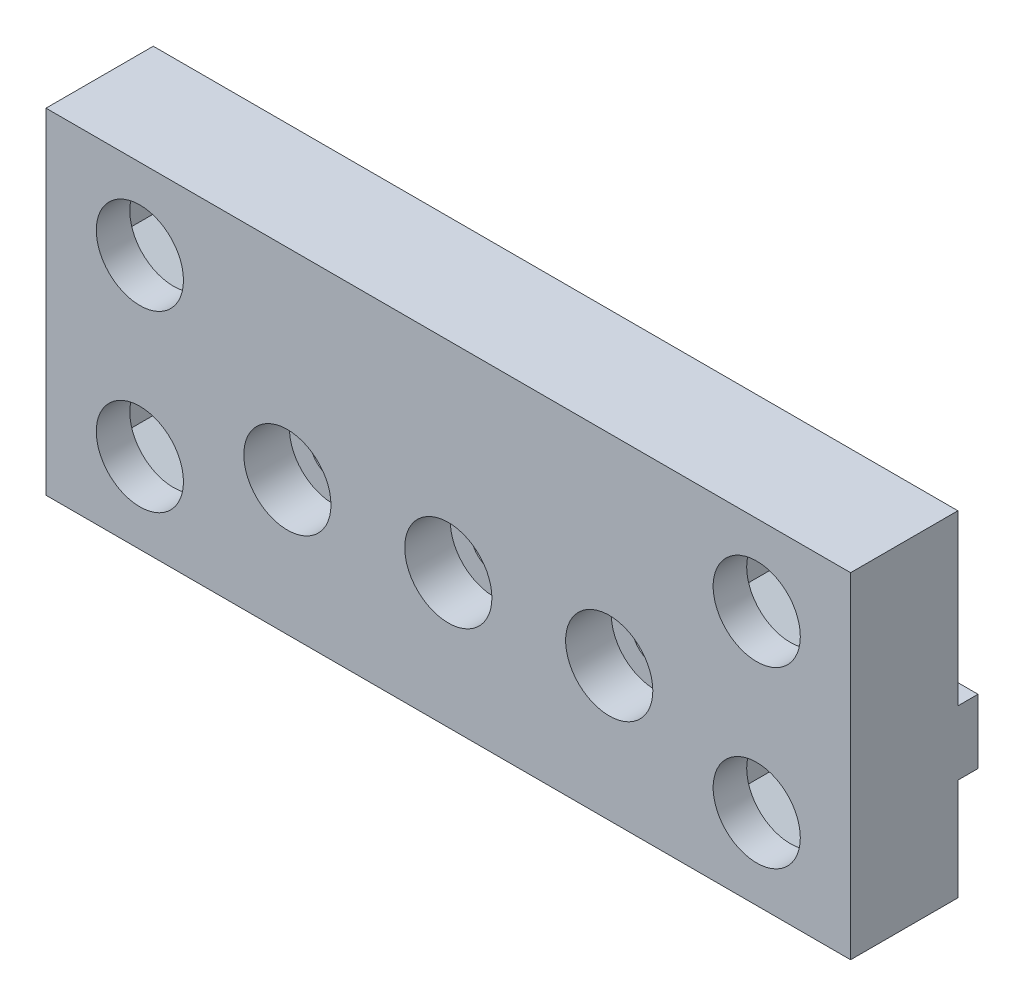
ISO-10303-21;
HEADER;
FILE_DESCRIPTION(('STEP AP214'),'2;1');
FILE_NAME('part.step','',(''),(''),'','','');
FILE_SCHEMA(('AUTOMOTIVE_DESIGN { 1 0 10303 214 1 1 1 1 }'));
ENDSEC;
DATA;
#1=APPLICATION_CONTEXT('core data for automotive mechanical design processes');
#2=APPLICATION_PROTOCOL_DEFINITION('international standard','automotive_design',2000,#1);
#3=PRODUCT_CONTEXT('',#1,'mechanical');
#4=PRODUCT('Part','Part','',(#3));
#5=PRODUCT_RELATED_PRODUCT_CATEGORY('part','',(#4));
#6=PRODUCT_DEFINITION_FORMATION('','',#4);
#7=PRODUCT_DEFINITION_CONTEXT('part definition',#1,'design');
#8=PRODUCT_DEFINITION('design','',#6,#7);
#9=PRODUCT_DEFINITION_SHAPE('','',#8);
#10=(LENGTH_UNIT() NAMED_UNIT(*) SI_UNIT(.MILLI.,.METRE.));
#11=(NAMED_UNIT(*) PLANE_ANGLE_UNIT() SI_UNIT($,.RADIAN.));
#12=(NAMED_UNIT(*) SI_UNIT($,.STERADIAN.) SOLID_ANGLE_UNIT());
#13=UNCERTAINTY_MEASURE_WITH_UNIT(LENGTH_MEASURE(1.E-05),#10,'distance_accuracy_value','');
#14=(GEOMETRIC_REPRESENTATION_CONTEXT(3) GLOBAL_UNCERTAINTY_ASSIGNED_CONTEXT((#13)) GLOBAL_UNIT_ASSIGNED_CONTEXT((#10,
#11,#12)) REPRESENTATION_CONTEXT('',''));
#15=CARTESIAN_POINT('',(0.,0.,0.));
#16=DIRECTION('',(0.,0.,1.));
#17=DIRECTION('',(1.,0.,0.));
#18=AXIS2_PLACEMENT_3D('',#15,#16,#17);
#19=CARTESIAN_POINT('',(30.,-4.9,-5.5));
#20=DIRECTION('',(0.,1.,0.));
#21=DIRECTION('',(0.,0.,1.));
#22=AXIS2_PLACEMENT_3D('',#19,#20,#21);
#23=PLANE('',#22);
#24=DIRECTION('',(0.,0.,-1.));
#25=VECTOR('',#24,1.);
#26=CARTESIAN_POINT('',(-28.1,-4.9,-5.5));
#27=LINE('',#26,#25);
#28=CARTESIAN_POINT('',(-28.1,-4.9,-4.));
#29=VERTEX_POINT('',#28);
#30=CARTESIAN_POINT('',(-28.1,-4.9,-5.5));
#31=VERTEX_POINT('',#30);
#32=EDGE_CURVE('E486',#29,#31,#27,.T.);
#33=ORIENTED_EDGE('',*,*,#32,.F.);
#34=DIRECTION('',(1.,0.,0.));
#35=VECTOR('',#34,1.);
#36=CARTESIAN_POINT('',(0.,-4.9,-4.));
#37=LINE('',#36,#35);
#38=CARTESIAN_POINT('',(-30.,-4.9,-4.));
#39=VERTEX_POINT('',#38);
#40=EDGE_CURVE('E584',#39,#29,#37,.T.);
#41=ORIENTED_EDGE('',*,*,#40,.F.);
#42=DIRECTION('',(0.,0.,1.));
#43=VECTOR('',#42,1.);
#44=CARTESIAN_POINT('',(-30.,-4.9,-5.5));
#45=LINE('',#44,#43);
#46=CARTESIAN_POINT('',(-30.,-4.9,-5.5));
#47=VERTEX_POINT('',#46);
#48=EDGE_CURVE('E530',#47,#39,#45,.T.);
#49=ORIENTED_EDGE('',*,*,#48,.F.);
#50=DIRECTION('',(-1.,0.,0.));
#51=VECTOR('',#50,1.);
#52=CARTESIAN_POINT('',(30.,-4.9,-5.5));
#53=LINE('',#52,#51);
#54=EDGE_CURVE('E526',#31,#47,#53,.T.);
#55=ORIENTED_EDGE('',*,*,#54,.F.);
#56=EDGE_LOOP('',(#33,#41,#49,#55));
#57=FACE_BOUND('',#56,.T.);
#58=ADVANCED_FACE('F41',(#57),#23,.F.);
#59=DIRECTION('',(0.,0.,-1.));
#60=VECTOR('',#59,1.);
#61=CARTESIAN_POINT('',(17.9,-4.9,-5.5));
#62=LINE('',#61,#60);
#63=CARTESIAN_POINT('',(17.9,-4.9,-4.));
#64=VERTEX_POINT('',#63);
#65=CARTESIAN_POINT('',(17.9,-4.9,-5.5));
#66=VERTEX_POINT('',#65);
#67=EDGE_CURVE('E498',#64,#66,#62,.T.);
#68=ORIENTED_EDGE('',*,*,#67,.F.);
#69=CARTESIAN_POINT('',(-17.9,-4.9,-4.));
#70=VERTEX_POINT('',#69);
#71=EDGE_CURVE('E588',#70,#64,#37,.T.);
#72=ORIENTED_EDGE('',*,*,#71,.F.);
#73=DIRECTION('',(0.,0.,1.));
#74=VECTOR('',#73,1.);
#75=CARTESIAN_POINT('',(-17.9,-4.9,-5.5));
#76=LINE('',#75,#74);
#77=CARTESIAN_POINT('',(-17.9,-4.9,-5.5));
#78=VERTEX_POINT('',#77);
#79=EDGE_CURVE('E493',#78,#70,#76,.T.);
#80=ORIENTED_EDGE('',*,*,#79,.F.);
#81=EDGE_CURVE('E531',#66,#78,#53,.T.);
#82=ORIENTED_EDGE('',*,*,#81,.F.);
#83=EDGE_LOOP('',(#68,#72,#80,#82));
#84=FACE_BOUND('',#83,.T.);
#85=ADVANCED_FACE('F692',(#84),#23,.F.);
#86=CARTESIAN_POINT('',(0.,0.,-4.));
#87=DIRECTION('',(0.,0.,-1.));
#88=DIRECTION('',(-1.,0.,0.));
#89=AXIS2_PLACEMENT_3D('',#86,#87,#88);
#90=PLANE('',#89);
#91=DIRECTION('',(-0.866025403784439,0.499999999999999,0.));
#92=VECTOR('',#91,1.);
#93=CARTESIAN_POINT('',(11.1145825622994,19.2510217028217,-4.));
#94=LINE('',#93,#92);
#95=CARTESIAN_POINT('',(28.1,9.44448637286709,-4.));
#96=VERTEX_POINT('',#95);
#97=CARTESIAN_POINT('',(23.,12.3889727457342,-4.));
#98=VERTEX_POINT('',#97);
#99=EDGE_CURVE('E632',#96,#98,#94,.T.);
#100=ORIENTED_EDGE('',*,*,#99,.T.);
#101=DIRECTION('',(-0.866025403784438,-0.500000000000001,0.));
#102=VECTOR('',#101,1.);
#103=CARTESIAN_POINT('',(0.385417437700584,-0.667562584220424,-4.));
#104=LINE('',#103,#102);
#105=CARTESIAN_POINT('',(17.9,9.44448637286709,-4.));
#106=VERTEX_POINT('',#105);
#107=EDGE_CURVE('E636',#98,#106,#104,.T.);
#108=ORIENTED_EDGE('',*,*,#107,.T.);
#109=DIRECTION('',(0.,-1.,0.));
#110=VECTOR('',#109,1.);
#111=CARTESIAN_POINT('',(17.9,0.,-4.));
#112=LINE('',#111,#110);
#113=CARTESIAN_POINT('',(17.9,3.5555136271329,-4.));
#114=VERTEX_POINT('',#113);
#115=EDGE_CURVE('E618',#106,#114,#112,.T.);
#116=ORIENTED_EDGE('',*,*,#115,.T.);
#117=DIRECTION('',(0.866025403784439,-0.499999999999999,0.));
#118=VECTOR('',#117,1.);
#119=CARTESIAN_POINT('',(6.01458256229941,10.4175625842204,-4.));
#120=LINE('',#119,#118);
#121=CARTESIAN_POINT('',(23.,0.611027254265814,-4.));
#122=VERTEX_POINT('',#121);
#123=EDGE_CURVE('E622',#114,#122,#120,.T.);
#124=ORIENTED_EDGE('',*,*,#123,.T.);
#125=DIRECTION('',(0.866025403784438,0.5,0.));
#126=VECTOR('',#125,1.);
#127=CARTESIAN_POINT('',(5.48541743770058,-9.50102170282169,-4.));
#128=LINE('',#127,#126);
#129=CARTESIAN_POINT('',(28.1,3.55551362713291,-4.));
#130=VERTEX_POINT('',#129);
#131=EDGE_CURVE('E626',#122,#130,#128,.T.);
#132=ORIENTED_EDGE('',*,*,#131,.T.);
#133=DIRECTION('',(0.,1.,0.));
#134=VECTOR('',#133,1.);
#135=CARTESIAN_POINT('',(28.1,0.,-4.));
#136=LINE('',#135,#134);
#137=EDGE_CURVE('E629',#130,#96,#136,.T.);
#138=ORIENTED_EDGE('',*,*,#137,.T.);
#139=EDGE_LOOP('',(#100,#108,#116,#124,#132,#138));
#140=FACE_BOUND('',#139,.T.);
#141=DIRECTION('',(0.,1.,0.));
#142=VECTOR('',#141,1.);
#143=CARTESIAN_POINT('',(30.,-12.5,-4.));
#144=LINE('',#143,#142);
#145=CARTESIAN_POINT('',(30.,-0.0999999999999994,-4.));
#146=VERTEX_POINT('',#145);
#147=CARTESIAN_POINT('',(30.,12.5,-4.));
#148=VERTEX_POINT('',#147);
#149=EDGE_CURVE('E543',#146,#148,#144,.T.);
#150=ORIENTED_EDGE('',*,*,#149,.F.);
#151=DIRECTION('',(-1.,0.,0.));
#152=VECTOR('',#151,1.);
#153=CARTESIAN_POINT('',(0.,-0.0999999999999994,-4.));
#154=LINE('',#153,#152);
#155=CARTESIAN_POINT('',(-30.,-0.0999999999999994,-4.));
#156=VERTEX_POINT('',#155);
#157=EDGE_CURVE('E587',#146,#156,#154,.T.);
#158=ORIENTED_EDGE('',*,*,#157,.T.);
#159=DIRECTION('',(0.,-1.,0.));
#160=VECTOR('',#159,1.);
#161=CARTESIAN_POINT('',(-30.,-12.5,-4.));
#162=LINE('',#161,#160);
#163=CARTESIAN_POINT('',(-30.,12.5,-4.));
#164=VERTEX_POINT('',#163);
#165=EDGE_CURVE('E565',#164,#156,#162,.T.);
#166=ORIENTED_EDGE('',*,*,#165,.F.);
#167=DIRECTION('',(-1.,0.,0.));
#168=VECTOR('',#167,1.);
#169=CARTESIAN_POINT('',(-30.,12.5,-4.));
#170=LINE('',#169,#168);
#171=EDGE_CURVE('E561',#148,#164,#170,.T.);
#172=ORIENTED_EDGE('',*,*,#171,.F.);
#173=EDGE_LOOP('',(#150,#158,#166,#172));
#174=FACE_BOUND('',#173,.T.);
#175=DIRECTION('',(-0.866025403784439,0.5,0.));
#176=VECTOR('',#175,1.);
#177=CARTESIAN_POINT('',(-0.385417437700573,-0.667562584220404,-4.));
#178=LINE('',#177,#176);
#179=CARTESIAN_POINT('',(-17.9,9.44448637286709,-4.));
#180=VERTEX_POINT('',#179);
#181=CARTESIAN_POINT('',(-23.,12.3889727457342,-4.));
#182=VERTEX_POINT('',#181);
#183=EDGE_CURVE('E50',#180,#182,#178,.T.);
#184=ORIENTED_EDGE('',*,*,#183,.T.);
#185=DIRECTION('',(-0.866025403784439,-0.5,0.));
#186=VECTOR('',#185,1.);
#187=CARTESIAN_POINT('',(-11.1145825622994,19.2510217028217,-4.));
#188=LINE('',#187,#186);
#189=CARTESIAN_POINT('',(-28.1,9.44448637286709,-4.));
#190=VERTEX_POINT('',#189);
#191=EDGE_CURVE('E11',#182,#190,#188,.T.);
#192=ORIENTED_EDGE('',*,*,#191,.T.);
#193=DIRECTION('',(0.,-1.,0.));
#194=VECTOR('',#193,1.);
#195=CARTESIAN_POINT('',(-28.1,0.,-4.));
#196=LINE('',#195,#194);
#197=CARTESIAN_POINT('',(-28.1,3.55551362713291,-4.));
#198=VERTEX_POINT('',#197);
#199=EDGE_CURVE('E640',#190,#198,#196,.T.);
#200=ORIENTED_EDGE('',*,*,#199,.T.);
#201=DIRECTION('',(0.866025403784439,-0.5,0.));
#202=VECTOR('',#201,1.);
#203=CARTESIAN_POINT('',(-5.48541743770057,-9.50102170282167,-4.));
#204=LINE('',#203,#202);
#205=CARTESIAN_POINT('',(-23.,0.611027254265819,-4.));
#206=VERTEX_POINT('',#205);
#207=EDGE_CURVE('E644',#198,#206,#204,.T.);
#208=ORIENTED_EDGE('',*,*,#207,.T.);
#209=DIRECTION('',(0.866025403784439,0.5,0.));
#210=VECTOR('',#209,1.);
#211=CARTESIAN_POINT('',(-6.01458256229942,10.4175625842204,-4.));
#212=LINE('',#211,#210);
#213=CARTESIAN_POINT('',(-17.9,3.55551362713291,-4.));
#214=VERTEX_POINT('',#213);
#215=EDGE_CURVE('E648',#206,#214,#212,.T.);
#216=ORIENTED_EDGE('',*,*,#215,.T.);
#217=DIRECTION('',(0.,1.,0.));
#218=VECTOR('',#217,1.);
#219=CARTESIAN_POINT('',(-17.9,0.,-4.));
#220=LINE('',#219,#218);
#221=EDGE_CURVE('E652',#214,#180,#220,.T.);
#222=ORIENTED_EDGE('',*,*,#221,.T.);
#223=EDGE_LOOP('',(#184,#192,#200,#208,#216,#222));
#224=FACE_BOUND('',#223,.T.);
#225=ADVANCED_FACE('F658',(#140,#174,#224),#90,.T.);
#226=DIRECTION('',(0.866025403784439,0.5,0.));
#227=VECTOR('',#226,1.);
#228=CARTESIAN_POINT('',(11.1145825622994,-19.2510217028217,-4.));
#229=LINE('',#228,#227);
#230=CARTESIAN_POINT('',(23.,-12.3889727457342,-4.));
#231=VERTEX_POINT('',#230);
#232=CARTESIAN_POINT('',(28.1,-9.44448637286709,-4.));
#233=VERTEX_POINT('',#232);
#234=EDGE_CURVE('E615',#231,#233,#229,.T.);
#235=ORIENTED_EDGE('',*,*,#234,.T.);
#236=DIRECTION('',(0.,1.,0.));
#237=VECTOR('',#236,1.);
#238=CARTESIAN_POINT('',(28.1,0.,-4.));
#239=LINE('',#238,#237);
#240=CARTESIAN_POINT('',(28.1,-4.9,-4.));
#241=VERTEX_POINT('',#240);
#242=EDGE_CURVE('E502',#233,#241,#239,.T.);
#243=ORIENTED_EDGE('',*,*,#242,.T.);
#244=CARTESIAN_POINT('',(30.,-4.9,-4.));
#245=VERTEX_POINT('',#244);
#246=EDGE_CURVE('E583',#241,#245,#37,.T.);
#247=ORIENTED_EDGE('',*,*,#246,.T.);
#248=CARTESIAN_POINT('',(30.,-12.5,-4.));
#249=VERTEX_POINT('',#248);
#250=EDGE_CURVE('E558',#249,#245,#144,.T.);
#251=ORIENTED_EDGE('',*,*,#250,.F.);
#252=DIRECTION('',(1.,0.,0.));
#253=VECTOR('',#252,1.);
#254=CARTESIAN_POINT('',(-30.,-12.5,-4.));
#255=LINE('',#254,#253);
#256=CARTESIAN_POINT('',(-30.,-12.5,-4.));
#257=VERTEX_POINT('',#256);
#258=EDGE_CURVE('E548',#257,#249,#255,.T.);
#259=ORIENTED_EDGE('',*,*,#258,.F.);
#260=EDGE_CURVE('E564',#39,#257,#162,.T.);
#261=ORIENTED_EDGE('',*,*,#260,.F.);
#262=ORIENTED_EDGE('',*,*,#40,.T.);
#263=DIRECTION('',(0.,-1.,0.));
#264=VECTOR('',#263,1.);
#265=CARTESIAN_POINT('',(-28.1,0.,-4.));
#266=LINE('',#265,#264);
#267=CARTESIAN_POINT('',(-28.1,-9.44448637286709,-4.));
#268=VERTEX_POINT('',#267);
#269=EDGE_CURVE('E482',#29,#268,#266,.T.);
#270=ORIENTED_EDGE('',*,*,#269,.T.);
#271=DIRECTION('',(0.866025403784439,-0.5,0.));
#272=VECTOR('',#271,1.);
#273=CARTESIAN_POINT('',(-11.1145825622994,-19.2510217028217,-4.));
#274=LINE('',#273,#272);
#275=CARTESIAN_POINT('',(-23.,-12.3889727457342,-4.));
#276=VERTEX_POINT('',#275);
#277=EDGE_CURVE('E592',#268,#276,#274,.T.);
#278=ORIENTED_EDGE('',*,*,#277,.T.);
#279=DIRECTION('',(0.866025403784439,0.5,0.));
#280=VECTOR('',#279,1.);
#281=CARTESIAN_POINT('',(-0.385417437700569,0.667562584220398,-4.));
#282=LINE('',#281,#280);
#283=CARTESIAN_POINT('',(-17.9,-9.44448637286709,-4.));
#284=VERTEX_POINT('',#283);
#285=EDGE_CURVE('E608',#276,#284,#282,.T.);
#286=ORIENTED_EDGE('',*,*,#285,.T.);
#287=DIRECTION('',(0.,1.,0.));
#288=VECTOR('',#287,1.);
#289=CARTESIAN_POINT('',(-17.9,0.,-4.));
#290=LINE('',#289,#288);
#291=EDGE_CURVE('E489',#284,#70,#290,.T.);
#292=ORIENTED_EDGE('',*,*,#291,.T.);
#293=ORIENTED_EDGE('',*,*,#71,.T.);
#294=DIRECTION('',(0.,-1.,0.));
#295=VECTOR('',#294,1.);
#296=CARTESIAN_POINT('',(17.9,0.,-4.));
#297=LINE('',#296,#295);
#298=CARTESIAN_POINT('',(17.9,-9.4444863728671,-4.));
#299=VERTEX_POINT('',#298);
#300=EDGE_CURVE('E495',#64,#299,#297,.T.);
#301=ORIENTED_EDGE('',*,*,#300,.T.);
#302=DIRECTION('',(0.866025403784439,-0.5,0.));
#303=VECTOR('',#302,1.);
#304=CARTESIAN_POINT('',(0.385417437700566,0.667562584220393,-4.));
#305=LINE('',#304,#303);
#306=EDGE_CURVE('E612',#299,#231,#305,.T.);
#307=ORIENTED_EDGE('',*,*,#306,.T.);
#308=EDGE_LOOP('',(#235,#243,#247,#251,#259,#261,#262,#270,#278,#286,#292,#293,#301,#307));
#309=FACE_BOUND('',#308,.T.);
#310=ADVANCED_FACE('F705',(#309),#90,.T.);
#311=DIRECTION('',(0.,0.,1.));
#312=VECTOR('',#311,1.);
#313=CARTESIAN_POINT('',(28.1,-4.9,-5.5));
#314=LINE('',#313,#312);
#315=CARTESIAN_POINT('',(28.1,-4.9,-5.5));
#316=VERTEX_POINT('',#315);
#317=EDGE_CURVE('E500',#316,#241,#314,.T.);
#318=ORIENTED_EDGE('',*,*,#317,.F.);
#319=CARTESIAN_POINT('',(30.,-4.9,-5.5));
#320=VERTEX_POINT('',#319);
#321=EDGE_CURVE('E527',#320,#316,#53,.T.);
#322=ORIENTED_EDGE('',*,*,#321,.F.);
#323=DIRECTION('',(0.,0.,1.));
#324=VECTOR('',#323,1.);
#325=CARTESIAN_POINT('',(30.,-4.9,-5.5));
#326=LINE('',#325,#324);
#327=EDGE_CURVE('E534',#320,#245,#326,.T.);
#328=ORIENTED_EDGE('',*,*,#327,.T.);
#329=ORIENTED_EDGE('',*,*,#246,.F.);
#330=EDGE_LOOP('',(#318,#322,#328,#329));
#331=FACE_BOUND('',#330,.T.);
#332=ADVANCED_FACE('F695',(#331),#23,.F.);
#333=CARTESIAN_POINT('',(0.,0.,-5.5));
#334=DIRECTION('',(0.,0.,1.));
#335=DIRECTION('',(1.,0.,0.));
#336=AXIS2_PLACEMENT_3D('',#333,#334,#335);
#337=PLANE('',#336);
#338=CARTESIAN_POINT('',(-12.,-2.5,-5.5));
#339=DIRECTION('',(0.,0.,1.));
#340=DIRECTION('',(1.,0.,0.));
#341=AXIS2_PLACEMENT_3D('',#338,#339,#340);
#342=CIRCLE('',#341,1.7);
#343=CARTESIAN_POINT('',(-10.3,-2.5,-5.5));
#344=VERTEX_POINT('',#343);
#345=EDGE_CURVE('E1091',#344,#344,#342,.T.);
#346=ORIENTED_EDGE('',*,*,#345,.T.);
#347=EDGE_LOOP('',(#346));
#348=FACE_BOUND('',#347,.T.);
#349=CARTESIAN_POINT('',(0.,-2.5,-5.5));
#350=DIRECTION('',(0.,0.,1.));
#351=DIRECTION('',(1.,0.,0.));
#352=AXIS2_PLACEMENT_3D('',#349,#350,#351);
#353=CIRCLE('',#352,1.7);
#354=CARTESIAN_POINT('',(1.7,-2.5,-5.5));
#355=VERTEX_POINT('',#354);
#356=EDGE_CURVE('E1107',#355,#355,#353,.T.);
#357=ORIENTED_EDGE('',*,*,#356,.T.);
#358=EDGE_LOOP('',(#357));
#359=FACE_BOUND('',#358,.T.);
#360=CARTESIAN_POINT('',(12.,-2.5,-5.5));
#361=DIRECTION('',(0.,0.,1.));
#362=DIRECTION('',(1.,0.,0.));
#363=AXIS2_PLACEMENT_3D('',#360,#361,#362);
#364=CIRCLE('',#363,1.7);
#365=CARTESIAN_POINT('',(13.7,-2.5,-5.5));
#366=VERTEX_POINT('',#365);
#367=EDGE_CURVE('E329',#366,#366,#364,.T.);
#368=ORIENTED_EDGE('',*,*,#367,.T.);
#369=EDGE_LOOP('',(#368));
#370=FACE_BOUND('',#369,.T.);
#371=DIRECTION('',(0.,-1.,0.));
#372=VECTOR('',#371,1.);
#373=CARTESIAN_POINT('',(28.1,-3.55551362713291,-5.5));
#374=LINE('',#373,#372);
#375=CARTESIAN_POINT('',(28.1,-3.55551362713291,-5.5));
#376=VERTEX_POINT('',#375);
#377=EDGE_CURVE('E432',#376,#316,#374,.T.);
#378=ORIENTED_EDGE('',*,*,#377,.F.);
#379=DIRECTION('',(0.866025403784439,-0.5,0.));
#380=VECTOR('',#379,1.);
#381=CARTESIAN_POINT('',(23.,-0.611027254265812,-5.5));
#382=LINE('',#381,#380);
#383=CARTESIAN_POINT('',(23.,-0.611027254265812,-5.5));
#384=VERTEX_POINT('',#383);
#385=EDGE_CURVE('E430',#384,#376,#382,.T.);
#386=ORIENTED_EDGE('',*,*,#385,.F.);
#387=DIRECTION('',(0.866025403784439,0.5,0.));
#388=VECTOR('',#387,1.);
#389=CARTESIAN_POINT('',(17.9,-3.55551362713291,-5.5));
#390=LINE('',#389,#388);
#391=CARTESIAN_POINT('',(17.9,-3.55551362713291,-5.5));
#392=VERTEX_POINT('',#391);
#393=EDGE_CURVE('E428',#392,#384,#390,.T.);
#394=ORIENTED_EDGE('',*,*,#393,.F.);
#395=DIRECTION('',(0.,1.,0.));
#396=VECTOR('',#395,1.);
#397=CARTESIAN_POINT('',(17.9,-9.4444863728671,-5.5));
#398=LINE('',#397,#396);
#399=EDGE_CURVE('E434',#66,#392,#398,.T.);
#400=ORIENTED_EDGE('',*,*,#399,.F.);
#401=ORIENTED_EDGE('',*,*,#81,.T.);
#402=DIRECTION('',(0.,-1.,0.));
#403=VECTOR('',#402,1.);
#404=CARTESIAN_POINT('',(-17.9,-3.55551362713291,-5.5));
#405=LINE('',#404,#403);
#406=CARTESIAN_POINT('',(-17.9,-3.55551362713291,-5.5));
#407=VERTEX_POINT('',#406);
#408=EDGE_CURVE('E353',#407,#78,#405,.T.);
#409=ORIENTED_EDGE('',*,*,#408,.F.);
#410=DIRECTION('',(0.866025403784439,-0.5,0.));
#411=VECTOR('',#410,1.);
#412=CARTESIAN_POINT('',(-23.,-0.611027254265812,-5.5));
#413=LINE('',#412,#411);
#414=CARTESIAN_POINT('',(-23.,-0.611027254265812,-5.5));
#415=VERTEX_POINT('',#414);
#416=EDGE_CURVE('E350',#415,#407,#413,.T.);
#417=ORIENTED_EDGE('',*,*,#416,.F.);
#418=DIRECTION('',(0.866025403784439,0.5,0.));
#419=VECTOR('',#418,1.);
#420=CARTESIAN_POINT('',(-28.1,-3.5555136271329,-5.5));
#421=LINE('',#420,#419);
#422=CARTESIAN_POINT('',(-28.1,-3.5555136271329,-5.5));
#423=VERTEX_POINT('',#422);
#424=EDGE_CURVE('E308',#423,#415,#421,.T.);
#425=ORIENTED_EDGE('',*,*,#424,.F.);
#426=DIRECTION('',(0.,1.,0.));
#427=VECTOR('',#426,1.);
#428=CARTESIAN_POINT('',(-28.1,-9.44448637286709,-5.5));
#429=LINE('',#428,#427);
#430=EDGE_CURVE('E355',#31,#423,#429,.T.);
#431=ORIENTED_EDGE('',*,*,#430,.F.);
#432=ORIENTED_EDGE('',*,*,#54,.T.);
#433=DIRECTION('',(0.,1.,0.));
#434=VECTOR('',#433,1.);
#435=CARTESIAN_POINT('',(-30.,-4.9,-5.5));
#436=LINE('',#435,#434);
#437=CARTESIAN_POINT('',(-30.,-0.0999999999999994,-5.5));
#438=VERTEX_POINT('',#437);
#439=EDGE_CURVE('E518',#47,#438,#436,.T.);
#440=ORIENTED_EDGE('',*,*,#439,.T.);
#441=DIRECTION('',(1.,0.,0.));
#442=VECTOR('',#441,1.);
#443=CARTESIAN_POINT('',(30.,-0.0999999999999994,-5.5));
#444=LINE('',#443,#442);
#445=CARTESIAN_POINT('',(30.,-0.0999999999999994,-5.5));
#446=VERTEX_POINT('',#445);
#447=EDGE_CURVE('E521',#438,#446,#444,.T.);
#448=ORIENTED_EDGE('',*,*,#447,.T.);
#449=DIRECTION('',(0.,-1.,0.));
#450=VECTOR('',#449,1.);
#451=CARTESIAN_POINT('',(30.,-4.9,-5.5));
#452=LINE('',#451,#450);
#453=EDGE_CURVE('E524',#446,#320,#452,.T.);
#454=ORIENTED_EDGE('',*,*,#453,.T.);
#455=ORIENTED_EDGE('',*,*,#321,.T.);
#456=EDGE_LOOP('',(#378,#386,#394,#400,#401,#409,#417,#425,#431,#432,#440,#448,#454,#455));
#457=FACE_BOUND('',#456,.T.);
#458=ADVANCED_FACE('F704',(#348,#359,#370,#457),#337,.F.);
#459=CARTESIAN_POINT('',(23.,-6.5,4.));
#460=DIRECTION('',(0.,0.,1.));
#461=DIRECTION('',(1.,0.,0.));
#462=AXIS2_PLACEMENT_3D('',#459,#460,#461);
#463=CYLINDRICAL_SURFACE('',#462,3.25);
#464=CARTESIAN_POINT('',(23.,-6.5,4.));
#465=DIRECTION('',(0.,0.,1.));
#466=DIRECTION('',(1.,0.,0.));
#467=AXIS2_PLACEMENT_3D('',#464,#465,#466);
#468=CIRCLE('',#467,3.25);
#469=CARTESIAN_POINT('',(26.25,-6.5,4.));
#470=VERTEX_POINT('',#469);
#471=EDGE_CURVE('E515',#470,#470,#468,.T.);
#472=ORIENTED_EDGE('',*,*,#471,.T.);
#473=EDGE_LOOP('',(#472));
#474=FACE_BOUND('',#473,.T.);
#475=CARTESIAN_POINT('',(23.,-6.5,1.5));
#476=DIRECTION('',(0.,0.,-1.));
#477=DIRECTION('',(-1.,0.,0.));
#478=AXIS2_PLACEMENT_3D('',#475,#476,#477);
#479=CIRCLE('',#478,3.25);
#480=CARTESIAN_POINT('',(19.75,-6.5,1.5));
#481=VERTEX_POINT('',#480);
#482=EDGE_CURVE('E487',#481,#481,#479,.F.);
#483=ORIENTED_EDGE('',*,*,#482,.F.);
#484=EDGE_LOOP('',(#483));
#485=FACE_BOUND('',#484,.T.);
#486=ADVANCED_FACE('F711',(#474,#485),#463,.F.);
#487=CARTESIAN_POINT('',(-23.,-6.5,4.));
#488=DIRECTION('',(0.,0.,1.));
#489=DIRECTION('',(1.,0.,0.));
#490=AXIS2_PLACEMENT_3D('',#487,#488,#489);
#491=CYLINDRICAL_SURFACE('',#490,3.25);
#492=CARTESIAN_POINT('',(-23.,-6.5,4.));
#493=DIRECTION('',(0.,0.,1.));
#494=DIRECTION('',(1.,0.,0.));
#495=AXIS2_PLACEMENT_3D('',#492,#493,#494);
#496=CIRCLE('',#495,3.25);
#497=CARTESIAN_POINT('',(-19.75,-6.5,4.));
#498=VERTEX_POINT('',#497);
#499=EDGE_CURVE('E511',#498,#498,#496,.T.);
#500=ORIENTED_EDGE('',*,*,#499,.T.);
#501=EDGE_LOOP('',(#500));
#502=FACE_BOUND('',#501,.T.);
#503=CARTESIAN_POINT('',(-23.,-6.5,1.5));
#504=DIRECTION('',(0.,0.,-1.));
#505=DIRECTION('',(-1.,0.,0.));
#506=AXIS2_PLACEMENT_3D('',#503,#504,#505);
#507=CIRCLE('',#506,3.25);
#508=CARTESIAN_POINT('',(-26.25,-6.5,1.5));
#509=VERTEX_POINT('',#508);
#510=EDGE_CURVE('E599',#509,#509,#507,.F.);
#511=ORIENTED_EDGE('',*,*,#510,.F.);
#512=EDGE_LOOP('',(#511));
#513=FACE_BOUND('',#512,.T.);
#514=ADVANCED_FACE('F813',(#502,#513),#491,.F.);
#515=CARTESIAN_POINT('',(23.,6.5,4.));
#516=DIRECTION('',(0.,0.,1.));
#517=DIRECTION('',(1.,0.,0.));
#518=AXIS2_PLACEMENT_3D('',#515,#516,#517);
#519=CYLINDRICAL_SURFACE('',#518,3.25);
#520=CARTESIAN_POINT('',(23.,6.5,4.));
#521=DIRECTION('',(0.,0.,1.));
#522=DIRECTION('',(1.,0.,0.));
#523=AXIS2_PLACEMENT_3D('',#520,#521,#522);
#524=CIRCLE('',#523,3.25);
#525=CARTESIAN_POINT('',(26.25,6.5,4.));
#526=VERTEX_POINT('',#525);
#527=EDGE_CURVE('E508',#526,#526,#524,.T.);
#528=ORIENTED_EDGE('',*,*,#527,.T.);
#529=EDGE_LOOP('',(#528));
#530=FACE_BOUND('',#529,.T.);
#531=CARTESIAN_POINT('',(23.,6.5,1.5));
#532=DIRECTION('',(0.,0.,-1.));
#533=DIRECTION('',(-1.,0.,0.));
#534=AXIS2_PLACEMENT_3D('',#531,#532,#533);
#535=CIRCLE('',#534,3.25);
#536=CARTESIAN_POINT('',(19.75,6.5,1.5));
#537=VERTEX_POINT('',#536);
#538=EDGE_CURVE('E596',#537,#537,#535,.F.);
#539=ORIENTED_EDGE('',*,*,#538,.F.);
#540=EDGE_LOOP('',(#539));
#541=FACE_BOUND('',#540,.T.);
#542=ADVANCED_FACE('F809',(#530,#541),#519,.F.);
#543=CARTESIAN_POINT('',(-23.,6.5,4.));
#544=DIRECTION('',(0.,0.,1.));
#545=DIRECTION('',(1.,0.,0.));
#546=AXIS2_PLACEMENT_3D('',#543,#544,#545);
#547=CYLINDRICAL_SURFACE('',#546,3.25);
#548=CARTESIAN_POINT('',(-23.,6.5,4.));
#549=DIRECTION('',(0.,0.,1.));
#550=DIRECTION('',(1.,0.,0.));
#551=AXIS2_PLACEMENT_3D('',#548,#549,#550);
#552=CIRCLE('',#551,3.25);
#553=CARTESIAN_POINT('',(-19.75,6.5,4.));
#554=VERTEX_POINT('',#553);
#555=EDGE_CURVE('E505',#554,#554,#552,.T.);
#556=ORIENTED_EDGE('',*,*,#555,.T.);
#557=EDGE_LOOP('',(#556));
#558=FACE_BOUND('',#557,.T.);
#559=CARTESIAN_POINT('',(-23.,6.5,1.5));
#560=DIRECTION('',(0.,0.,-1.));
#561=DIRECTION('',(-1.,0.,0.));
#562=AXIS2_PLACEMENT_3D('',#559,#560,#561);
#563=CIRCLE('',#562,3.25);
#564=CARTESIAN_POINT('',(-26.25,6.5,1.5));
#565=VERTEX_POINT('',#564);
#566=EDGE_CURVE('E481',#565,#565,#563,.F.);
#567=ORIENTED_EDGE('',*,*,#566,.F.);
#568=EDGE_LOOP('',(#567));
#569=FACE_BOUND('',#568,.T.);
#570=ADVANCED_FACE('F806',(#558,#569),#547,.F.);
#571=CARTESIAN_POINT('',(30.,-12.5,4.));
#572=DIRECTION('',(-1.,0.,0.));
#573=DIRECTION('',(0.,0.,1.));
#574=AXIS2_PLACEMENT_3D('',#571,#572,#573);
#575=PLANE('',#574);
#576=ORIENTED_EDGE('',*,*,#250,.T.);
#577=ORIENTED_EDGE('',*,*,#327,.F.);
#578=ORIENTED_EDGE('',*,*,#453,.F.);
#579=DIRECTION('',(0.,0.,1.));
#580=VECTOR('',#579,1.);
#581=CARTESIAN_POINT('',(30.,-0.0999999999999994,-5.5));
#582=LINE('',#581,#580);
#583=EDGE_CURVE('E537',#446,#146,#582,.T.);
#584=ORIENTED_EDGE('',*,*,#583,.T.);
#585=ORIENTED_EDGE('',*,*,#149,.T.);
#586=DIRECTION('',(0.,0.,-1.));
#587=VECTOR('',#586,1.);
#588=CARTESIAN_POINT('',(30.,12.5,4.));
#589=LINE('',#588,#587);
#590=CARTESIAN_POINT('',(30.,12.5,4.));
#591=VERTEX_POINT('',#590);
#592=EDGE_CURVE('E580',#591,#148,#589,.T.);
#593=ORIENTED_EDGE('',*,*,#592,.F.);
#594=DIRECTION('',(0.,1.,0.));
#595=VECTOR('',#594,1.);
#596=CARTESIAN_POINT('',(30.,-12.5,4.));
#597=LINE('',#596,#595);
#598=CARTESIAN_POINT('',(30.,-12.5,4.));
#599=VERTEX_POINT('',#598);
#600=EDGE_CURVE('E544',#599,#591,#597,.T.);
#601=ORIENTED_EDGE('',*,*,#600,.F.);
#602=DIRECTION('',(0.,0.,-1.));
#603=VECTOR('',#602,1.);
#604=CARTESIAN_POINT('',(30.,-12.5,4.));
#605=LINE('',#604,#603);
#606=EDGE_CURVE('E557',#599,#249,#605,.T.);
#607=ORIENTED_EDGE('',*,*,#606,.T.);
#608=EDGE_LOOP('',(#576,#577,#578,#584,#585,#593,#601,#607));
#609=FACE_BOUND('',#608,.T.);
#610=ADVANCED_FACE('F43',(#609),#575,.F.);
#611=CARTESIAN_POINT('',(-30.,12.5,4.));
#612=DIRECTION('',(0.,-1.,0.));
#613=DIRECTION('',(0.,0.,-1.));
#614=AXIS2_PLACEMENT_3D('',#611,#612,#613);
#615=PLANE('',#614);
#616=ORIENTED_EDGE('',*,*,#171,.T.);
#617=DIRECTION('',(0.,0.,-1.));
#618=VECTOR('',#617,1.);
#619=CARTESIAN_POINT('',(-30.,12.5,4.));
#620=LINE('',#619,#618);
#621=CARTESIAN_POINT('',(-30.,12.5,4.));
#622=VERTEX_POINT('',#621);
#623=EDGE_CURVE('E577',#622,#164,#620,.T.);
#624=ORIENTED_EDGE('',*,*,#623,.F.);
#625=DIRECTION('',(-1.,0.,0.));
#626=VECTOR('',#625,1.);
#627=CARTESIAN_POINT('',(-30.,12.5,4.));
#628=LINE('',#627,#626);
#629=EDGE_CURVE('E547',#591,#622,#628,.T.);
#630=ORIENTED_EDGE('',*,*,#629,.F.);
#631=ORIENTED_EDGE('',*,*,#592,.T.);
#632=EDGE_LOOP('',(#616,#624,#630,#631));
#633=FACE_BOUND('',#632,.T.);
#634=ADVANCED_FACE('F1140',(#633),#615,.F.);
#635=CARTESIAN_POINT('',(-30.,-12.5,4.));
#636=DIRECTION('',(1.,0.,0.));
#637=DIRECTION('',(0.,0.,-1.));
#638=AXIS2_PLACEMENT_3D('',#635,#636,#637);
#639=PLANE('',#638);
#640=ORIENTED_EDGE('',*,*,#165,.T.);
#641=DIRECTION('',(0.,0.,1.));
#642=VECTOR('',#641,1.);
#643=CARTESIAN_POINT('',(-30.,-0.0999999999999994,-5.5));
#644=LINE('',#643,#642);
#645=EDGE_CURVE('E540',#438,#156,#644,.T.);
#646=ORIENTED_EDGE('',*,*,#645,.F.);
#647=ORIENTED_EDGE('',*,*,#439,.F.);
#648=ORIENTED_EDGE('',*,*,#48,.T.);
#649=ORIENTED_EDGE('',*,*,#260,.T.);
#650=DIRECTION('',(0.,0.,-1.));
#651=VECTOR('',#650,1.);
#652=CARTESIAN_POINT('',(-30.,-12.5,4.));
#653=LINE('',#652,#651);
#654=CARTESIAN_POINT('',(-30.,-12.5,4.));
#655=VERTEX_POINT('',#654);
#656=EDGE_CURVE('E573',#655,#257,#653,.T.);
#657=ORIENTED_EDGE('',*,*,#656,.F.);
#658=DIRECTION('',(0.,-1.,0.));
#659=VECTOR('',#658,1.);
#660=CARTESIAN_POINT('',(-30.,-12.5,4.));
#661=LINE('',#660,#659);
#662=EDGE_CURVE('E551',#622,#655,#661,.T.);
#663=ORIENTED_EDGE('',*,*,#662,.F.);
#664=ORIENTED_EDGE('',*,*,#623,.T.);
#665=EDGE_LOOP('',(#640,#646,#647,#648,#649,#657,#663,#664));
#666=FACE_BOUND('',#665,.T.);
#667=ADVANCED_FACE('F1145',(#666),#639,.F.);
#668=CARTESIAN_POINT('',(-30.,-12.5,4.));
#669=DIRECTION('',(0.,1.,0.));
#670=DIRECTION('',(0.,0.,1.));
#671=AXIS2_PLACEMENT_3D('',#668,#669,#670);
#672=PLANE('',#671);
#673=ORIENTED_EDGE('',*,*,#258,.T.);
#674=ORIENTED_EDGE('',*,*,#606,.F.);
#675=DIRECTION('',(1.,0.,0.));
#676=VECTOR('',#675,1.);
#677=CARTESIAN_POINT('',(-30.,-12.5,4.));
#678=LINE('',#677,#676);
#679=EDGE_CURVE('E554',#655,#599,#678,.T.);
#680=ORIENTED_EDGE('',*,*,#679,.F.);
#681=ORIENTED_EDGE('',*,*,#656,.T.);
#682=EDGE_LOOP('',(#673,#674,#680,#681));
#683=FACE_BOUND('',#682,.T.);
#684=ADVANCED_FACE('F990',(#683),#672,.F.);
#685=CARTESIAN_POINT('',(0.,0.,4.));
#686=DIRECTION('',(0.,0.,-1.));
#687=DIRECTION('',(-1.,0.,0.));
#688=AXIS2_PLACEMENT_3D('',#685,#686,#687);
#689=PLANE('',#688);
#690=CARTESIAN_POINT('',(-12.,-2.5,4.));
#691=DIRECTION('',(0.,0.,1.));
#692=DIRECTION('',(1.,0.,0.));
#693=AXIS2_PLACEMENT_3D('',#690,#691,#692);
#694=CIRCLE('',#693,3.25);
#695=CARTESIAN_POINT('',(-8.75,-2.5,4.));
#696=VERTEX_POINT('',#695);
#697=EDGE_CURVE('E1081',#696,#696,#694,.T.);
#698=ORIENTED_EDGE('',*,*,#697,.F.);
#699=EDGE_LOOP('',(#698));
#700=FACE_BOUND('',#699,.T.);
#701=CARTESIAN_POINT('',(0.,-2.5,4.));
#702=DIRECTION('',(0.,0.,1.));
#703=DIRECTION('',(1.,0.,0.));
#704=AXIS2_PLACEMENT_3D('',#701,#702,#703);
#705=CIRCLE('',#704,3.25);
#706=CARTESIAN_POINT('',(3.25,-2.5,4.));
#707=VERTEX_POINT('',#706);
#708=EDGE_CURVE('E1095',#707,#707,#705,.T.);
#709=ORIENTED_EDGE('',*,*,#708,.F.);
#710=EDGE_LOOP('',(#709));
#711=FACE_BOUND('',#710,.T.);
#712=CARTESIAN_POINT('',(12.,-2.5,4.));
#713=DIRECTION('',(0.,0.,1.));
#714=DIRECTION('',(1.,0.,0.));
#715=AXIS2_PLACEMENT_3D('',#712,#713,#714);
#716=CIRCLE('',#715,3.25);
#717=CARTESIAN_POINT('',(15.25,-2.5,4.));
#718=VERTEX_POINT('',#717);
#719=EDGE_CURVE('E1111',#718,#718,#716,.T.);
#720=ORIENTED_EDGE('',*,*,#719,.F.);
#721=EDGE_LOOP('',(#720));
#722=FACE_BOUND('',#721,.T.);
#723=ORIENTED_EDGE('',*,*,#555,.F.);
#724=EDGE_LOOP('',(#723));
#725=FACE_BOUND('',#724,.T.);
#726=ORIENTED_EDGE('',*,*,#527,.F.);
#727=EDGE_LOOP('',(#726));
#728=FACE_BOUND('',#727,.T.);
#729=ORIENTED_EDGE('',*,*,#499,.F.);
#730=EDGE_LOOP('',(#729));
#731=FACE_BOUND('',#730,.T.);
#732=ORIENTED_EDGE('',*,*,#471,.F.);
#733=EDGE_LOOP('',(#732));
#734=FACE_BOUND('',#733,.T.);
#735=ORIENTED_EDGE('',*,*,#600,.T.);
#736=ORIENTED_EDGE('',*,*,#629,.T.);
#737=ORIENTED_EDGE('',*,*,#662,.T.);
#738=ORIENTED_EDGE('',*,*,#679,.T.);
#739=EDGE_LOOP('',(#735,#736,#737,#738));
#740=FACE_BOUND('',#739,.T.);
#741=ADVANCED_FACE('F985',(#700,#711,#722,#725,#728,#731,#734,#740),#689,.F.);
#742=CARTESIAN_POINT('',(30.,-0.0999999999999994,-5.5));
#743=DIRECTION('',(0.,-1.,0.));
#744=DIRECTION('',(0.,0.,-1.));
#745=AXIS2_PLACEMENT_3D('',#742,#743,#744);
#746=PLANE('',#745);
#747=ORIENTED_EDGE('',*,*,#157,.F.);
#748=ORIENTED_EDGE('',*,*,#583,.F.);
#749=ORIENTED_EDGE('',*,*,#447,.F.);
#750=ORIENTED_EDGE('',*,*,#645,.T.);
#751=EDGE_LOOP('',(#747,#748,#749,#750));
#752=FACE_BOUND('',#751,.T.);
#753=ADVANCED_FACE('F874',(#752),#746,.F.);
#754=CARTESIAN_POINT('',(0.,0.,1.5));
#755=DIRECTION('',(0.,0.,-1.));
#756=DIRECTION('',(-1.,0.,0.));
#757=AXIS2_PLACEMENT_3D('',#754,#755,#756);
#758=PLANE('',#757);
#759=DIRECTION('',(0.866025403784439,0.5,0.));
#760=VECTOR('',#759,1.);
#761=CARTESIAN_POINT('',(-28.1,9.44448637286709,1.5));
#762=LINE('',#761,#760);
#763=CARTESIAN_POINT('',(-28.1,9.44448637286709,1.5));
#764=VERTEX_POINT('',#763);
#765=CARTESIAN_POINT('',(-23.,12.3889727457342,1.5));
#766=VERTEX_POINT('',#765);
#767=EDGE_CURVE('E369',#764,#766,#762,.T.);
#768=ORIENTED_EDGE('',*,*,#767,.T.);
#769=DIRECTION('',(0.866025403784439,-0.5,0.));
#770=VECTOR('',#769,1.);
#771=CARTESIAN_POINT('',(-23.,12.3889727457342,1.5));
#772=LINE('',#771,#770);
#773=CARTESIAN_POINT('',(-17.9,9.44448637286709,1.5));
#774=VERTEX_POINT('',#773);
#775=EDGE_CURVE('E373',#766,#774,#772,.T.);
#776=ORIENTED_EDGE('',*,*,#775,.T.);
#777=DIRECTION('',(0.,-1.,0.));
#778=VECTOR('',#777,1.);
#779=CARTESIAN_POINT('',(-17.9,9.44448637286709,1.5));
#780=LINE('',#779,#778);
#781=CARTESIAN_POINT('',(-17.9,3.55551362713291,1.5));
#782=VERTEX_POINT('',#781);
#783=EDGE_CURVE('E378',#774,#782,#780,.T.);
#784=ORIENTED_EDGE('',*,*,#783,.T.);
#785=DIRECTION('',(-0.866025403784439,-0.5,0.));
#786=VECTOR('',#785,1.);
#787=CARTESIAN_POINT('',(-17.9,3.55551362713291,1.5));
#788=LINE('',#787,#786);
#789=CARTESIAN_POINT('',(-23.,0.611027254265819,1.5));
#790=VERTEX_POINT('',#789);
#791=EDGE_CURVE('E382',#782,#790,#788,.T.);
#792=ORIENTED_EDGE('',*,*,#791,.T.);
#793=DIRECTION('',(-0.866025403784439,0.5,0.));
#794=VECTOR('',#793,1.);
#795=CARTESIAN_POINT('',(-23.,0.611027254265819,1.5));
#796=LINE('',#795,#794);
#797=CARTESIAN_POINT('',(-28.1,3.55551362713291,1.5));
#798=VERTEX_POINT('',#797);
#799=EDGE_CURVE('E385',#790,#798,#796,.T.);
#800=ORIENTED_EDGE('',*,*,#799,.T.);
#801=DIRECTION('',(0.,1.,0.));
#802=VECTOR('',#801,1.);
#803=CARTESIAN_POINT('',(-28.1,3.55551362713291,1.5));
#804=LINE('',#803,#802);
#805=EDGE_CURVE('E389',#798,#764,#804,.T.);
#806=ORIENTED_EDGE('',*,*,#805,.T.);
#807=EDGE_LOOP('',(#768,#776,#784,#792,#800,#806));
#808=FACE_BOUND('',#807,.T.);
#809=ORIENTED_EDGE('',*,*,#566,.T.);
#810=EDGE_LOOP('',(#809));
#811=FACE_BOUND('',#810,.T.);
#812=ADVANCED_FACE('F670',(#808,#811),#758,.T.);
#813=CARTESIAN_POINT('',(-28.1,9.44448637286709,-5.5));
#814=DIRECTION('',(0.5,-0.866025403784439,0.));
#815=DIRECTION('',(0.866025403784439,0.5,0.));
#816=AXIS2_PLACEMENT_3D('',#813,#814,#815);
#817=PLANE('',#816);
#818=DIRECTION('',(0.,0.,1.));
#819=VECTOR('',#818,1.);
#820=CARTESIAN_POINT('',(-23.,12.3889727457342,-5.5));
#821=LINE('',#820,#819);
#822=EDGE_CURVE('E407',#182,#766,#821,.T.);
#823=ORIENTED_EDGE('',*,*,#822,.T.);
#824=ORIENTED_EDGE('',*,*,#767,.F.);
#825=DIRECTION('',(0.,0.,1.));
#826=VECTOR('',#825,1.);
#827=CARTESIAN_POINT('',(-28.1,9.44448637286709,-5.5));
#828=LINE('',#827,#826);
#829=EDGE_CURVE('E393',#190,#764,#828,.T.);
#830=ORIENTED_EDGE('',*,*,#829,.F.);
#831=ORIENTED_EDGE('',*,*,#191,.F.);
#832=EDGE_LOOP('',(#823,#824,#830,#831));
#833=FACE_BOUND('',#832,.T.);
#834=ADVANCED_FACE('F675',(#833),#817,.T.);
#835=CARTESIAN_POINT('',(-23.,12.3889727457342,-5.5));
#836=DIRECTION('',(-0.5,-0.866025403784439,0.));
#837=DIRECTION('',(0.866025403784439,-0.5,0.));
#838=AXIS2_PLACEMENT_3D('',#835,#836,#837);
#839=PLANE('',#838);
#840=DIRECTION('',(0.,0.,1.));
#841=VECTOR('',#840,1.);
#842=CARTESIAN_POINT('',(-17.9,9.44448637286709,-5.5));
#843=LINE('',#842,#841);
#844=EDGE_CURVE('E404',#180,#774,#843,.T.);
#845=ORIENTED_EDGE('',*,*,#844,.T.);
#846=ORIENTED_EDGE('',*,*,#775,.F.);
#847=ORIENTED_EDGE('',*,*,#822,.F.);
#848=ORIENTED_EDGE('',*,*,#183,.F.);
#849=EDGE_LOOP('',(#845,#846,#847,#848));
#850=FACE_BOUND('',#849,.T.);
#851=ADVANCED_FACE('F662',(#850),#839,.T.);
#852=CARTESIAN_POINT('',(-17.9,9.44448637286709,-5.5));
#853=DIRECTION('',(-1.,0.,0.));
#854=DIRECTION('',(0.,0.,1.));
#855=AXIS2_PLACEMENT_3D('',#852,#853,#854);
#856=PLANE('',#855);
#857=DIRECTION('',(0.,0.,1.));
#858=VECTOR('',#857,1.);
#859=CARTESIAN_POINT('',(-17.9,3.55551362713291,-5.5));
#860=LINE('',#859,#858);
#861=EDGE_CURVE('E401',#214,#782,#860,.T.);
#862=ORIENTED_EDGE('',*,*,#861,.T.);
#863=ORIENTED_EDGE('',*,*,#783,.F.);
#864=ORIENTED_EDGE('',*,*,#844,.F.);
#865=ORIENTED_EDGE('',*,*,#221,.F.);
#866=EDGE_LOOP('',(#862,#863,#864,#865));
#867=FACE_BOUND('',#866,.T.);
#868=ADVANCED_FACE('F666',(#867),#856,.T.);
#869=CARTESIAN_POINT('',(-17.9,3.55551362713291,-5.5));
#870=DIRECTION('',(-0.5,0.866025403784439,0.));
#871=DIRECTION('',(-0.866025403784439,-0.5,0.));
#872=AXIS2_PLACEMENT_3D('',#869,#870,#871);
#873=PLANE('',#872);
#874=DIRECTION('',(0.,0.,1.));
#875=VECTOR('',#874,1.);
#876=CARTESIAN_POINT('',(-23.,0.611027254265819,-5.5));
#877=LINE('',#876,#875);
#878=EDGE_CURVE('E398',#206,#790,#877,.T.);
#879=ORIENTED_EDGE('',*,*,#878,.T.);
#880=ORIENTED_EDGE('',*,*,#791,.F.);
#881=ORIENTED_EDGE('',*,*,#861,.F.);
#882=ORIENTED_EDGE('',*,*,#215,.F.);
#883=EDGE_LOOP('',(#879,#880,#881,#882));
#884=FACE_BOUND('',#883,.T.);
#885=ADVANCED_FACE('F682',(#884),#873,.T.);
#886=CARTESIAN_POINT('',(-23.,0.611027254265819,-5.5));
#887=DIRECTION('',(0.5,0.866025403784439,0.));
#888=DIRECTION('',(-0.866025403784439,0.5,0.));
#889=AXIS2_PLACEMENT_3D('',#886,#887,#888);
#890=PLANE('',#889);
#891=DIRECTION('',(0.,0.,1.));
#892=VECTOR('',#891,1.);
#893=CARTESIAN_POINT('',(-28.1,3.55551362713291,-5.5));
#894=LINE('',#893,#892);
#895=EDGE_CURVE('E60',#198,#798,#894,.T.);
#896=ORIENTED_EDGE('',*,*,#895,.T.);
#897=ORIENTED_EDGE('',*,*,#799,.F.);
#898=ORIENTED_EDGE('',*,*,#878,.F.);
#899=ORIENTED_EDGE('',*,*,#207,.F.);
#900=EDGE_LOOP('',(#896,#897,#898,#899));
#901=FACE_BOUND('',#900,.T.);
#902=ADVANCED_FACE('F679',(#901),#890,.T.);
#903=CARTESIAN_POINT('',(-28.1,3.55551362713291,-5.5));
#904=DIRECTION('',(1.,0.,0.));
#905=DIRECTION('',(0.,0.,-1.));
#906=AXIS2_PLACEMENT_3D('',#903,#904,#905);
#907=PLANE('',#906);
#908=ORIENTED_EDGE('',*,*,#829,.T.);
#909=ORIENTED_EDGE('',*,*,#805,.F.);
#910=ORIENTED_EDGE('',*,*,#895,.F.);
#911=ORIENTED_EDGE('',*,*,#199,.F.);
#912=EDGE_LOOP('',(#908,#909,#910,#911));
#913=FACE_BOUND('',#912,.T.);
#914=ADVANCED_FACE('F676',(#913),#907,.T.);
#915=CARTESIAN_POINT('',(0.,0.,1.5));
#916=DIRECTION('',(0.,0.,-1.));
#917=DIRECTION('',(-1.,0.,0.));
#918=AXIS2_PLACEMENT_3D('',#915,#916,#917);
#919=PLANE('',#918);
#920=DIRECTION('',(0.866025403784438,0.500000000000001,0.));
#921=VECTOR('',#920,1.);
#922=CARTESIAN_POINT('',(17.9,9.44448637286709,1.5));
#923=LINE('',#922,#921);
#924=CARTESIAN_POINT('',(17.9,9.44448637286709,1.5));
#925=VERTEX_POINT('',#924);
#926=CARTESIAN_POINT('',(23.,12.3889727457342,1.5));
#927=VERTEX_POINT('',#926);
#928=EDGE_CURVE('E410',#925,#927,#923,.T.);
#929=ORIENTED_EDGE('',*,*,#928,.T.);
#930=DIRECTION('',(0.866025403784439,-0.499999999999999,0.));
#931=VECTOR('',#930,1.);
#932=CARTESIAN_POINT('',(23.,12.3889727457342,1.5));
#933=LINE('',#932,#931);
#934=CARTESIAN_POINT('',(28.1,9.44448637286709,1.5));
#935=VERTEX_POINT('',#934);
#936=EDGE_CURVE('E450',#927,#935,#933,.T.);
#937=ORIENTED_EDGE('',*,*,#936,.T.);
#938=DIRECTION('',(0.,-1.,0.));
#939=VECTOR('',#938,1.);
#940=CARTESIAN_POINT('',(28.1,9.44448637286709,1.5));
#941=LINE('',#940,#939);
#942=CARTESIAN_POINT('',(28.1,3.55551362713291,1.5));
#943=VERTEX_POINT('',#942);
#944=EDGE_CURVE('E453',#935,#943,#941,.T.);
#945=ORIENTED_EDGE('',*,*,#944,.T.);
#946=DIRECTION('',(-0.866025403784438,-0.5,0.));
#947=VECTOR('',#946,1.);
#948=CARTESIAN_POINT('',(28.1,3.55551362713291,1.5));
#949=LINE('',#948,#947);
#950=CARTESIAN_POINT('',(23.,0.611027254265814,1.5));
#951=VERTEX_POINT('',#950);
#952=EDGE_CURVE('E456',#943,#951,#949,.T.);
#953=ORIENTED_EDGE('',*,*,#952,.T.);
#954=DIRECTION('',(-0.866025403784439,0.499999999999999,0.));
#955=VECTOR('',#954,1.);
#956=CARTESIAN_POINT('',(23.,0.611027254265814,1.5));
#957=LINE('',#956,#955);
#958=CARTESIAN_POINT('',(17.9,3.5555136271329,1.5));
#959=VERTEX_POINT('',#958);
#960=EDGE_CURVE('E459',#951,#959,#957,.T.);
#961=ORIENTED_EDGE('',*,*,#960,.T.);
#962=DIRECTION('',(0.,1.,0.));
#963=VECTOR('',#962,1.);
#964=CARTESIAN_POINT('',(17.9,3.5555136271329,1.5));
#965=LINE('',#964,#963);
#966=EDGE_CURVE('E463',#959,#925,#965,.T.);
#967=ORIENTED_EDGE('',*,*,#966,.T.);
#968=EDGE_LOOP('',(#929,#937,#945,#953,#961,#967));
#969=FACE_BOUND('',#968,.T.);
#970=ORIENTED_EDGE('',*,*,#538,.T.);
#971=EDGE_LOOP('',(#970));
#972=FACE_BOUND('',#971,.T.);
#973=ADVANCED_FACE('F778',(#969,#972),#919,.T.);
#974=CARTESIAN_POINT('',(17.9,9.44448637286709,-5.5));
#975=DIRECTION('',(0.500000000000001,-0.866025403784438,0.));
#976=DIRECTION('',(0.866025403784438,0.500000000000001,0.));
#977=AXIS2_PLACEMENT_3D('',#974,#975,#976);
#978=PLANE('',#977);
#979=DIRECTION('',(0.,0.,1.));
#980=VECTOR('',#979,1.);
#981=CARTESIAN_POINT('',(23.,12.3889727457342,-5.5));
#982=LINE('',#981,#980);
#983=EDGE_CURVE('E478',#98,#927,#982,.T.);
#984=ORIENTED_EDGE('',*,*,#983,.T.);
#985=ORIENTED_EDGE('',*,*,#928,.F.);
#986=DIRECTION('',(0.,0.,1.));
#987=VECTOR('',#986,1.);
#988=CARTESIAN_POINT('',(17.9,9.44448637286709,-5.5));
#989=LINE('',#988,#987);
#990=EDGE_CURVE('E467',#106,#925,#989,.T.);
#991=ORIENTED_EDGE('',*,*,#990,.F.);
#992=ORIENTED_EDGE('',*,*,#107,.F.);
#993=EDGE_LOOP('',(#984,#985,#991,#992));
#994=FACE_BOUND('',#993,.T.);
#995=ADVANCED_FACE('F781',(#994),#978,.T.);
#996=CARTESIAN_POINT('',(23.,12.3889727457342,-5.5));
#997=DIRECTION('',(-0.499999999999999,-0.866025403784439,0.));
#998=DIRECTION('',(0.866025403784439,-0.499999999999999,0.));
#999=AXIS2_PLACEMENT_3D('',#996,#997,#998);
#1000=PLANE('',#999);
#1001=DIRECTION('',(0.,0.,1.));
#1002=VECTOR('',#1001,1.);
#1003=CARTESIAN_POINT('',(28.1,9.44448637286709,-5.5));
#1004=LINE('',#1003,#1002);
#1005=EDGE_CURVE('E476',#96,#935,#1004,.T.);
#1006=ORIENTED_EDGE('',*,*,#1005,.T.);
#1007=ORIENTED_EDGE('',*,*,#936,.F.);
#1008=ORIENTED_EDGE('',*,*,#983,.F.);
#1009=ORIENTED_EDGE('',*,*,#99,.F.);
#1010=EDGE_LOOP('',(#1006,#1007,#1008,#1009));
#1011=FACE_BOUND('',#1010,.T.);
#1012=ADVANCED_FACE('F798',(#1011),#1000,.T.);
#1013=CARTESIAN_POINT('',(28.1,9.44448637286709,-5.5));
#1014=DIRECTION('',(-1.,0.,0.));
#1015=DIRECTION('',(0.,0.,1.));
#1016=AXIS2_PLACEMENT_3D('',#1013,#1014,#1015);
#1017=PLANE('',#1016);
#1018=DIRECTION('',(0.,0.,1.));
#1019=VECTOR('',#1018,1.);
#1020=CARTESIAN_POINT('',(28.1,3.55551362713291,-5.5));
#1021=LINE('',#1020,#1019);
#1022=EDGE_CURVE('E474',#130,#943,#1021,.T.);
#1023=ORIENTED_EDGE('',*,*,#1022,.T.);
#1024=ORIENTED_EDGE('',*,*,#944,.F.);
#1025=ORIENTED_EDGE('',*,*,#1005,.F.);
#1026=ORIENTED_EDGE('',*,*,#137,.F.);
#1027=EDGE_LOOP('',(#1023,#1024,#1025,#1026));
#1028=FACE_BOUND('',#1027,.T.);
#1029=ADVANCED_FACE('F794',(#1028),#1017,.T.);
#1030=CARTESIAN_POINT('',(28.1,3.55551362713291,-5.5));
#1031=DIRECTION('',(-0.5,0.866025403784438,0.));
#1032=DIRECTION('',(-0.866025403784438,-0.5,0.));
#1033=AXIS2_PLACEMENT_3D('',#1030,#1031,#1032);
#1034=PLANE('',#1033);
#1035=DIRECTION('',(0.,0.,1.));
#1036=VECTOR('',#1035,1.);
#1037=CARTESIAN_POINT('',(23.,0.611027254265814,-5.5));
#1038=LINE('',#1037,#1036);
#1039=EDGE_CURVE('E472',#122,#951,#1038,.T.);
#1040=ORIENTED_EDGE('',*,*,#1039,.T.);
#1041=ORIENTED_EDGE('',*,*,#952,.F.);
#1042=ORIENTED_EDGE('',*,*,#1022,.F.);
#1043=ORIENTED_EDGE('',*,*,#131,.F.);
#1044=EDGE_LOOP('',(#1040,#1041,#1042,#1043));
#1045=FACE_BOUND('',#1044,.T.);
#1046=ADVANCED_FACE('F790',(#1045),#1034,.T.);
#1047=CARTESIAN_POINT('',(23.,0.611027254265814,-5.5));
#1048=DIRECTION('',(0.499999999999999,0.866025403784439,0.));
#1049=DIRECTION('',(-0.866025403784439,0.499999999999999,0.));
#1050=AXIS2_PLACEMENT_3D('',#1047,#1048,#1049);
#1051=PLANE('',#1050);
#1052=DIRECTION('',(0.,0.,1.));
#1053=VECTOR('',#1052,1.);
#1054=CARTESIAN_POINT('',(17.9,3.5555136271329,-5.5));
#1055=LINE('',#1054,#1053);
#1056=EDGE_CURVE('E71',#114,#959,#1055,.T.);
#1057=ORIENTED_EDGE('',*,*,#1056,.T.);
#1058=ORIENTED_EDGE('',*,*,#960,.F.);
#1059=ORIENTED_EDGE('',*,*,#1039,.F.);
#1060=ORIENTED_EDGE('',*,*,#123,.F.);
#1061=EDGE_LOOP('',(#1057,#1058,#1059,#1060));
#1062=FACE_BOUND('',#1061,.T.);
#1063=ADVANCED_FACE('F787',(#1062),#1051,.T.);
#1064=CARTESIAN_POINT('',(17.9,3.5555136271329,-5.5));
#1065=DIRECTION('',(1.,0.,0.));
#1066=DIRECTION('',(0.,0.,-1.));
#1067=AXIS2_PLACEMENT_3D('',#1064,#1065,#1066);
#1068=PLANE('',#1067);
#1069=ORIENTED_EDGE('',*,*,#990,.T.);
#1070=ORIENTED_EDGE('',*,*,#966,.F.);
#1071=ORIENTED_EDGE('',*,*,#1056,.F.);
#1072=ORIENTED_EDGE('',*,*,#115,.F.);
#1073=EDGE_LOOP('',(#1069,#1070,#1071,#1072));
#1074=FACE_BOUND('',#1073,.T.);
#1075=ADVANCED_FACE('F783',(#1074),#1068,.T.);
#1076=CARTESIAN_POINT('',(-17.9,-3.55551362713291,-5.5));
#1077=DIRECTION('',(-1.,0.,0.));
#1078=DIRECTION('',(0.,0.,1.));
#1079=AXIS2_PLACEMENT_3D('',#1076,#1077,#1078);
#1080=PLANE('',#1079);
#1081=ORIENTED_EDGE('',*,*,#79,.T.);
#1082=ORIENTED_EDGE('',*,*,#291,.F.);
#1083=DIRECTION('',(0.,0.,1.));
#1084=VECTOR('',#1083,1.);
#1085=CARTESIAN_POINT('',(-17.9,-9.44448637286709,-5.5));
#1086=LINE('',#1085,#1084);
#1087=CARTESIAN_POINT('',(-17.9,-9.44448637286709,1.5));
#1088=VERTEX_POINT('',#1087);
#1089=EDGE_CURVE('E365',#284,#1088,#1086,.T.);
#1090=ORIENTED_EDGE('',*,*,#1089,.T.);
#1091=DIRECTION('',(0.,-1.,0.));
#1092=VECTOR('',#1091,1.);
#1093=CARTESIAN_POINT('',(-17.9,-3.55551362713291,1.5));
#1094=LINE('',#1093,#1092);
#1095=CARTESIAN_POINT('',(-17.9,-3.55551362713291,1.5));
#1096=VERTEX_POINT('',#1095);
#1097=EDGE_CURVE('E322',#1096,#1088,#1094,.T.);
#1098=ORIENTED_EDGE('',*,*,#1097,.F.);
#1099=DIRECTION('',(0.,0.,1.));
#1100=VECTOR('',#1099,1.);
#1101=CARTESIAN_POINT('',(-17.9,-3.55551362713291,-5.5));
#1102=LINE('',#1101,#1100);
#1103=EDGE_CURVE('E313',#407,#1096,#1102,.T.);
#1104=ORIENTED_EDGE('',*,*,#1103,.F.);
#1105=ORIENTED_EDGE('',*,*,#408,.T.);
#1106=EDGE_LOOP('',(#1081,#1082,#1090,#1098,#1104,#1105));
#1107=FACE_BOUND('',#1106,.T.);
#1108=ADVANCED_FACE('F786',(#1107),#1080,.T.);
#1109=CARTESIAN_POINT('',(-28.1,-9.44448637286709,-5.5));
#1110=DIRECTION('',(1.,0.,0.));
#1111=DIRECTION('',(0.,0.,-1.));
#1112=AXIS2_PLACEMENT_3D('',#1109,#1110,#1111);
#1113=PLANE('',#1112);
#1114=ORIENTED_EDGE('',*,*,#32,.T.);
#1115=ORIENTED_EDGE('',*,*,#430,.T.);
#1116=DIRECTION('',(0.,0.,1.));
#1117=VECTOR('',#1116,1.);
#1118=CARTESIAN_POINT('',(-28.1,-3.5555136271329,-5.5));
#1119=LINE('',#1118,#1117);
#1120=CARTESIAN_POINT('',(-28.1,-3.5555136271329,1.5));
#1121=VERTEX_POINT('',#1120);
#1122=EDGE_CURVE('E357',#423,#1121,#1119,.T.);
#1123=ORIENTED_EDGE('',*,*,#1122,.T.);
#1124=DIRECTION('',(0.,1.,0.));
#1125=VECTOR('',#1124,1.);
#1126=CARTESIAN_POINT('',(-28.1,-9.44448637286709,1.5));
#1127=LINE('',#1126,#1125);
#1128=CARTESIAN_POINT('',(-28.1,-9.44448637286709,1.5));
#1129=VERTEX_POINT('',#1128);
#1130=EDGE_CURVE('E328',#1129,#1121,#1127,.T.);
#1131=ORIENTED_EDGE('',*,*,#1130,.F.);
#1132=DIRECTION('',(0.,0.,1.));
#1133=VECTOR('',#1132,1.);
#1134=CARTESIAN_POINT('',(-28.1,-9.44448637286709,-5.5));
#1135=LINE('',#1134,#1133);
#1136=EDGE_CURVE('E359',#268,#1129,#1135,.T.);
#1137=ORIENTED_EDGE('',*,*,#1136,.F.);
#1138=ORIENTED_EDGE('',*,*,#269,.F.);
#1139=EDGE_LOOP('',(#1114,#1115,#1123,#1131,#1137,#1138));
#1140=FACE_BOUND('',#1139,.T.);
#1141=ADVANCED_FACE('F854',(#1140),#1113,.T.);
#1142=CARTESIAN_POINT('',(0.,0.,1.5));
#1143=DIRECTION('',(0.,0.,-1.));
#1144=DIRECTION('',(-1.,0.,0.));
#1145=AXIS2_PLACEMENT_3D('',#1142,#1143,#1144);
#1146=PLANE('',#1145);
#1147=DIRECTION('',(0.866025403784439,0.5,0.));
#1148=VECTOR('',#1147,1.);
#1149=CARTESIAN_POINT('',(-28.1,-3.5555136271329,1.5));
#1150=LINE('',#1149,#1148);
#1151=CARTESIAN_POINT('',(-23.,-0.611027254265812,1.5));
#1152=VERTEX_POINT('',#1151);
#1153=EDGE_CURVE('E305',#1121,#1152,#1150,.T.);
#1154=ORIENTED_EDGE('',*,*,#1153,.T.);
#1155=DIRECTION('',(0.866025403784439,-0.5,0.));
#1156=VECTOR('',#1155,1.);
#1157=CARTESIAN_POINT('',(-23.,-0.611027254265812,1.5));
#1158=LINE('',#1157,#1156);
#1159=EDGE_CURVE('E316',#1152,#1096,#1158,.T.);
#1160=ORIENTED_EDGE('',*,*,#1159,.T.);
#1161=ORIENTED_EDGE('',*,*,#1097,.T.);
#1162=DIRECTION('',(-0.866025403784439,-0.5,0.));
#1163=VECTOR('',#1162,1.);
#1164=CARTESIAN_POINT('',(-17.9,-9.44448637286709,1.5));
#1165=LINE('',#1164,#1163);
#1166=CARTESIAN_POINT('',(-23.,-12.3889727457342,1.5));
#1167=VERTEX_POINT('',#1166);
#1168=EDGE_CURVE('E339',#1088,#1167,#1165,.T.);
#1169=ORIENTED_EDGE('',*,*,#1168,.T.);
#1170=DIRECTION('',(-0.866025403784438,0.5,0.));
#1171=VECTOR('',#1170,1.);
#1172=CARTESIAN_POINT('',(-23.,-12.3889727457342,1.5));
#1173=LINE('',#1172,#1171);
#1174=EDGE_CURVE('E343',#1167,#1129,#1173,.T.);
#1175=ORIENTED_EDGE('',*,*,#1174,.T.);
#1176=ORIENTED_EDGE('',*,*,#1130,.T.);
#1177=EDGE_LOOP('',(#1154,#1160,#1161,#1169,#1175,#1176));
#1178=FACE_BOUND('',#1177,.T.);
#1179=ORIENTED_EDGE('',*,*,#510,.T.);
#1180=EDGE_LOOP('',(#1179));
#1181=FACE_BOUND('',#1180,.T.);
#1182=ADVANCED_FACE('F324',(#1178,#1181),#1146,.T.);
#1183=CARTESIAN_POINT('',(-28.1,-3.5555136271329,-5.5));
#1184=DIRECTION('',(0.5,-0.866025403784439,0.));
#1185=DIRECTION('',(0.866025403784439,0.5,0.));
#1186=AXIS2_PLACEMENT_3D('',#1183,#1184,#1185);
#1187=PLANE('',#1186);
#1188=ORIENTED_EDGE('',*,*,#1122,.F.);
#1189=ORIENTED_EDGE('',*,*,#424,.T.);
#1190=DIRECTION('',(0.,0.,1.));
#1191=VECTOR('',#1190,1.);
#1192=CARTESIAN_POINT('',(-23.,-0.611027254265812,-5.5));
#1193=LINE('',#1192,#1191);
#1194=EDGE_CURVE('E300',#415,#1152,#1193,.T.);
#1195=ORIENTED_EDGE('',*,*,#1194,.T.);
#1196=ORIENTED_EDGE('',*,*,#1153,.F.);
#1197=EDGE_LOOP('',(#1188,#1189,#1195,#1196));
#1198=FACE_BOUND('',#1197,.T.);
#1199=ADVANCED_FACE('F303',(#1198),#1187,.T.);
#1200=CARTESIAN_POINT('',(-23.,-0.611027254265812,-5.5));
#1201=DIRECTION('',(-0.5,-0.866025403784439,0.));
#1202=DIRECTION('',(0.866025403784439,-0.5,0.));
#1203=AXIS2_PLACEMENT_3D('',#1200,#1201,#1202);
#1204=PLANE('',#1203);
#1205=ORIENTED_EDGE('',*,*,#1194,.F.);
#1206=ORIENTED_EDGE('',*,*,#416,.T.);
#1207=ORIENTED_EDGE('',*,*,#1103,.T.);
#1208=ORIENTED_EDGE('',*,*,#1159,.F.);
#1209=EDGE_LOOP('',(#1205,#1206,#1207,#1208));
#1210=FACE_BOUND('',#1209,.T.);
#1211=ADVANCED_FACE('F317',(#1210),#1204,.T.);
#1212=CARTESIAN_POINT('',(-17.9,-9.44448637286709,-5.5));
#1213=DIRECTION('',(-0.5,0.866025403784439,0.));
#1214=DIRECTION('',(-0.866025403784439,-0.5,0.));
#1215=AXIS2_PLACEMENT_3D('',#1212,#1213,#1214);
#1216=PLANE('',#1215);
#1217=DIRECTION('',(0.,0.,1.));
#1218=VECTOR('',#1217,1.);
#1219=CARTESIAN_POINT('',(-23.,-12.3889727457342,-5.5));
#1220=LINE('',#1219,#1218);
#1221=EDGE_CURVE('E362',#276,#1167,#1220,.T.);
#1222=ORIENTED_EDGE('',*,*,#1221,.T.);
#1223=ORIENTED_EDGE('',*,*,#1168,.F.);
#1224=ORIENTED_EDGE('',*,*,#1089,.F.);
#1225=ORIENTED_EDGE('',*,*,#285,.F.);
#1226=EDGE_LOOP('',(#1222,#1223,#1224,#1225));
#1227=FACE_BOUND('',#1226,.T.);
#1228=ADVANCED_FACE('F860',(#1227),#1216,.T.);
#1229=CARTESIAN_POINT('',(-23.,-12.3889727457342,-5.5));
#1230=DIRECTION('',(0.5,0.866025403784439,0.));
#1231=DIRECTION('',(-0.866025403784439,0.5,0.));
#1232=AXIS2_PLACEMENT_3D('',#1229,#1230,#1231);
#1233=PLANE('',#1232);
#1234=ORIENTED_EDGE('',*,*,#1136,.T.);
#1235=ORIENTED_EDGE('',*,*,#1174,.F.);
#1236=ORIENTED_EDGE('',*,*,#1221,.F.);
#1237=ORIENTED_EDGE('',*,*,#277,.F.);
#1238=EDGE_LOOP('',(#1234,#1235,#1236,#1237));
#1239=FACE_BOUND('',#1238,.T.);
#1240=ADVANCED_FACE('F830',(#1239),#1233,.T.);
#1241=CARTESIAN_POINT('',(17.9,-9.4444863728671,-5.5));
#1242=DIRECTION('',(1.,0.,0.));
#1243=DIRECTION('',(0.,0.,-1.));
#1244=AXIS2_PLACEMENT_3D('',#1241,#1242,#1243);
#1245=PLANE('',#1244);
#1246=ORIENTED_EDGE('',*,*,#67,.T.);
#1247=ORIENTED_EDGE('',*,*,#399,.T.);
#1248=DIRECTION('',(0.,0.,1.));
#1249=VECTOR('',#1248,1.);
#1250=CARTESIAN_POINT('',(17.9,-3.55551362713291,-5.5));
#1251=LINE('',#1250,#1249);
#1252=CARTESIAN_POINT('',(17.9,-3.55551362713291,1.5));
#1253=VERTEX_POINT('',#1252);
#1254=EDGE_CURVE('E436',#392,#1253,#1251,.T.);
#1255=ORIENTED_EDGE('',*,*,#1254,.T.);
#1256=DIRECTION('',(0.,1.,0.));
#1257=VECTOR('',#1256,1.);
#1258=CARTESIAN_POINT('',(17.9,-9.4444863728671,1.5));
#1259=LINE('',#1258,#1257);
#1260=CARTESIAN_POINT('',(17.9,-9.4444863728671,1.5));
#1261=VERTEX_POINT('',#1260);
#1262=EDGE_CURVE('E425',#1261,#1253,#1259,.T.);
#1263=ORIENTED_EDGE('',*,*,#1262,.F.);
#1264=DIRECTION('',(0.,0.,1.));
#1265=VECTOR('',#1264,1.);
#1266=CARTESIAN_POINT('',(17.9,-9.4444863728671,-5.5));
#1267=LINE('',#1266,#1265);
#1268=EDGE_CURVE('E438',#299,#1261,#1267,.T.);
#1269=ORIENTED_EDGE('',*,*,#1268,.F.);
#1270=ORIENTED_EDGE('',*,*,#300,.F.);
#1271=EDGE_LOOP('',(#1246,#1247,#1255,#1263,#1269,#1270));
#1272=FACE_BOUND('',#1271,.T.);
#1273=ADVANCED_FACE('F739',(#1272),#1245,.T.);
#1274=CARTESIAN_POINT('',(0.,0.,1.5));
#1275=DIRECTION('',(0.,0.,-1.));
#1276=DIRECTION('',(-1.,0.,0.));
#1277=AXIS2_PLACEMENT_3D('',#1274,#1275,#1276);
#1278=PLANE('',#1277);
#1279=DIRECTION('',(0.866025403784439,0.5,0.));
#1280=VECTOR('',#1279,1.);
#1281=CARTESIAN_POINT('',(17.9,-3.55551362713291,1.5));
#1282=LINE('',#1281,#1280);
#1283=CARTESIAN_POINT('',(23.,-0.611027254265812,1.5));
#1284=VERTEX_POINT('',#1283);
#1285=EDGE_CURVE('E312',#1253,#1284,#1282,.T.);
#1286=ORIENTED_EDGE('',*,*,#1285,.T.);
#1287=DIRECTION('',(0.866025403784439,-0.5,0.));
#1288=VECTOR('',#1287,1.);
#1289=CARTESIAN_POINT('',(23.,-0.611027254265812,1.5));
#1290=LINE('',#1289,#1288);
#1291=CARTESIAN_POINT('',(28.1,-3.55551362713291,1.5));
#1292=VERTEX_POINT('',#1291);
#1293=EDGE_CURVE('E413',#1284,#1292,#1290,.T.);
#1294=ORIENTED_EDGE('',*,*,#1293,.T.);
#1295=DIRECTION('',(0.,-1.,0.));
#1296=VECTOR('',#1295,1.);
#1297=CARTESIAN_POINT('',(28.1,-3.55551362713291,1.5));
#1298=LINE('',#1297,#1296);
#1299=CARTESIAN_POINT('',(28.1,-9.44448637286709,1.5));
#1300=VERTEX_POINT('',#1299);
#1301=EDGE_CURVE('E416',#1292,#1300,#1298,.T.);
#1302=ORIENTED_EDGE('',*,*,#1301,.T.);
#1303=DIRECTION('',(-0.866025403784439,-0.5,0.));
#1304=VECTOR('',#1303,1.);
#1305=CARTESIAN_POINT('',(28.1,-9.44448637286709,1.5));
#1306=LINE('',#1305,#1304);
#1307=CARTESIAN_POINT('',(23.,-12.3889727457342,1.5));
#1308=VERTEX_POINT('',#1307);
#1309=EDGE_CURVE('E419',#1300,#1308,#1306,.T.);
#1310=ORIENTED_EDGE('',*,*,#1309,.T.);
#1311=DIRECTION('',(-0.866025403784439,0.5,0.));
#1312=VECTOR('',#1311,1.);
#1313=CARTESIAN_POINT('',(23.,-12.3889727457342,1.5));
#1314=LINE('',#1313,#1312);
#1315=EDGE_CURVE('E422',#1308,#1261,#1314,.T.);
#1316=ORIENTED_EDGE('',*,*,#1315,.T.);
#1317=ORIENTED_EDGE('',*,*,#1262,.T.);
#1318=EDGE_LOOP('',(#1286,#1294,#1302,#1310,#1316,#1317));
#1319=FACE_BOUND('',#1318,.T.);
#1320=ORIENTED_EDGE('',*,*,#482,.T.);
#1321=EDGE_LOOP('',(#1320));
#1322=FACE_BOUND('',#1321,.T.);
#1323=ADVANCED_FACE('F754',(#1319,#1322),#1278,.T.);
#1324=CARTESIAN_POINT('',(17.9,-3.55551362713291,-5.5));
#1325=DIRECTION('',(0.5,-0.866025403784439,0.));
#1326=DIRECTION('',(0.866025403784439,0.5,0.));
#1327=AXIS2_PLACEMENT_3D('',#1324,#1325,#1326);
#1328=PLANE('',#1327);
#1329=ORIENTED_EDGE('',*,*,#1254,.F.);
#1330=ORIENTED_EDGE('',*,*,#393,.T.);
#1331=DIRECTION('',(0.,0.,1.));
#1332=VECTOR('',#1331,1.);
#1333=CARTESIAN_POINT('',(23.,-0.611027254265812,-5.5));
#1334=LINE('',#1333,#1332);
#1335=EDGE_CURVE('E374',#384,#1284,#1334,.T.);
#1336=ORIENTED_EDGE('',*,*,#1335,.T.);
#1337=ORIENTED_EDGE('',*,*,#1285,.F.);
#1338=EDGE_LOOP('',(#1329,#1330,#1336,#1337));
#1339=FACE_BOUND('',#1338,.T.);
#1340=ADVANCED_FACE('F746',(#1339),#1328,.T.);
#1341=CARTESIAN_POINT('',(23.,-0.611027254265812,-5.5));
#1342=DIRECTION('',(-0.5,-0.866025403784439,0.));
#1343=DIRECTION('',(0.866025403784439,-0.5,0.));
#1344=AXIS2_PLACEMENT_3D('',#1341,#1342,#1343);
#1345=PLANE('',#1344);
#1346=ORIENTED_EDGE('',*,*,#1335,.F.);
#1347=ORIENTED_EDGE('',*,*,#385,.T.);
#1348=DIRECTION('',(0.,0.,1.));
#1349=VECTOR('',#1348,1.);
#1350=CARTESIAN_POINT('',(28.1,-3.55551362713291,-5.5));
#1351=LINE('',#1350,#1349);
#1352=EDGE_CURVE('E444',#376,#1292,#1351,.T.);
#1353=ORIENTED_EDGE('',*,*,#1352,.T.);
#1354=ORIENTED_EDGE('',*,*,#1293,.F.);
#1355=EDGE_LOOP('',(#1346,#1347,#1353,#1354));
#1356=FACE_BOUND('',#1355,.T.);
#1357=ADVANCED_FACE('F750',(#1356),#1345,.T.);
#1358=CARTESIAN_POINT('',(28.1,-3.55551362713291,-5.5));
#1359=DIRECTION('',(-1.,0.,0.));
#1360=DIRECTION('',(0.,0.,1.));
#1361=AXIS2_PLACEMENT_3D('',#1358,#1359,#1360);
#1362=PLANE('',#1361);
#1363=DIRECTION('',(0.,0.,1.));
#1364=VECTOR('',#1363,1.);
#1365=CARTESIAN_POINT('',(28.1,-9.44448637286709,-5.5));
#1366=LINE('',#1365,#1364);
#1367=EDGE_CURVE('E442',#233,#1300,#1366,.T.);
#1368=ORIENTED_EDGE('',*,*,#1367,.T.);
#1369=ORIENTED_EDGE('',*,*,#1301,.F.);
#1370=ORIENTED_EDGE('',*,*,#1352,.F.);
#1371=ORIENTED_EDGE('',*,*,#377,.T.);
#1372=ORIENTED_EDGE('',*,*,#317,.T.);
#1373=ORIENTED_EDGE('',*,*,#242,.F.);
#1374=EDGE_LOOP('',(#1368,#1369,#1370,#1371,#1372,#1373));
#1375=FACE_BOUND('',#1374,.T.);
#1376=ADVANCED_FACE('F765',(#1375),#1362,.T.);
#1377=CARTESIAN_POINT('',(28.1,-9.44448637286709,-5.5));
#1378=DIRECTION('',(-0.5,0.866025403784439,0.));
#1379=DIRECTION('',(-0.866025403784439,-0.5,0.));
#1380=AXIS2_PLACEMENT_3D('',#1377,#1378,#1379);
#1381=PLANE('',#1380);
#1382=DIRECTION('',(0.,0.,1.));
#1383=VECTOR('',#1382,1.);
#1384=CARTESIAN_POINT('',(23.,-12.3889727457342,-5.5));
#1385=LINE('',#1384,#1383);
#1386=EDGE_CURVE('E440',#231,#1308,#1385,.T.);
#1387=ORIENTED_EDGE('',*,*,#1386,.T.);
#1388=ORIENTED_EDGE('',*,*,#1309,.F.);
#1389=ORIENTED_EDGE('',*,*,#1367,.F.);
#1390=ORIENTED_EDGE('',*,*,#234,.F.);
#1391=EDGE_LOOP('',(#1387,#1388,#1389,#1390));
#1392=FACE_BOUND('',#1391,.T.);
#1393=ADVANCED_FACE('F763',(#1392),#1381,.T.);
#1394=CARTESIAN_POINT('',(23.,-12.3889727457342,-5.5));
#1395=DIRECTION('',(0.5,0.866025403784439,0.));
#1396=DIRECTION('',(-0.866025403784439,0.5,0.));
#1397=AXIS2_PLACEMENT_3D('',#1394,#1395,#1396);
#1398=PLANE('',#1397);
#1399=ORIENTED_EDGE('',*,*,#1268,.T.);
#1400=ORIENTED_EDGE('',*,*,#1315,.F.);
#1401=ORIENTED_EDGE('',*,*,#1386,.F.);
#1402=ORIENTED_EDGE('',*,*,#306,.F.);
#1403=EDGE_LOOP('',(#1399,#1400,#1401,#1402));
#1404=FACE_BOUND('',#1403,.T.);
#1405=ADVANCED_FACE('F759',(#1404),#1398,.T.);
#1406=CARTESIAN_POINT('',(12.,-2.5,4.));
#1407=DIRECTION('',(0.,0.,1.));
#1408=DIRECTION('',(1.,0.,0.));
#1409=AXIS2_PLACEMENT_3D('',#1406,#1407,#1408);
#1410=CYLINDRICAL_SURFACE('',#1409,1.7);
#1411=ORIENTED_EDGE('',*,*,#367,.F.);
#1412=EDGE_LOOP('',(#1411));
#1413=FACE_BOUND('',#1412,.T.);
#1414=CARTESIAN_POINT('',(12.,-2.5,0.600000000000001));
#1415=DIRECTION('',(0.,0.,1.));
#1416=DIRECTION('',(1.,0.,0.));
#1417=AXIS2_PLACEMENT_3D('',#1414,#1415,#1416);
#1418=CIRCLE('',#1417,1.7);
#1419=CARTESIAN_POINT('',(13.7,-2.5,0.600000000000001));
#1420=VERTEX_POINT('',#1419);
#1421=EDGE_CURVE('E333',#1420,#1420,#1418,.T.);
#1422=ORIENTED_EDGE('',*,*,#1421,.T.);
#1423=EDGE_LOOP('',(#1422));
#1424=FACE_BOUND('',#1423,.T.);
#1425=ADVANCED_FACE('F835',(#1413,#1424),#1410,.F.);
#1426=CARTESIAN_POINT('',(13.7,-2.5,0.600000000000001));
#1427=DIRECTION('',(0.,0.,-1.));
#1428=DIRECTION('',(-1.,0.,0.));
#1429=AXIS2_PLACEMENT_3D('',#1426,#1427,#1428);
#1430=PLANE('',#1429);
#1431=ORIENTED_EDGE('',*,*,#1421,.F.);
#1432=EDGE_LOOP('',(#1431));
#1433=FACE_BOUND('',#1432,.T.);
#1434=CARTESIAN_POINT('',(12.,-2.5,0.600000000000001));
#1435=DIRECTION('',(0.,0.,1.));
#1436=DIRECTION('',(1.,0.,0.));
#1437=AXIS2_PLACEMENT_3D('',#1434,#1435,#1436);
#1438=CIRCLE('',#1437,3.25);
#1439=CARTESIAN_POINT('',(15.25,-2.5,0.600000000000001));
#1440=VERTEX_POINT('',#1439);
#1441=EDGE_CURVE('E1115',#1440,#1440,#1438,.T.);
#1442=ORIENTED_EDGE('',*,*,#1441,.T.);
#1443=EDGE_LOOP('',(#1442));
#1444=FACE_BOUND('',#1443,.T.);
#1445=ADVANCED_FACE('F839',(#1433,#1444),#1430,.F.);
#1446=CARTESIAN_POINT('',(12.,-2.5,4.));
#1447=DIRECTION('',(0.,0.,1.));
#1448=DIRECTION('',(1.,0.,0.));
#1449=AXIS2_PLACEMENT_3D('',#1446,#1447,#1448);
#1450=CYLINDRICAL_SURFACE('',#1449,3.25);
#1451=ORIENTED_EDGE('',*,*,#1441,.F.);
#1452=EDGE_LOOP('',(#1451));
#1453=FACE_BOUND('',#1452,.T.);
#1454=ORIENTED_EDGE('',*,*,#719,.T.);
#1455=EDGE_LOOP('',(#1454));
#1456=FACE_BOUND('',#1455,.T.);
#1457=ADVANCED_FACE('F845',(#1453,#1456),#1450,.F.);
#1458=CARTESIAN_POINT('',(0.,-2.5,4.));
#1459=DIRECTION('',(0.,0.,1.));
#1460=DIRECTION('',(1.,0.,0.));
#1461=AXIS2_PLACEMENT_3D('',#1458,#1459,#1460);
#1462=CYLINDRICAL_SURFACE('',#1461,1.7);
#1463=ORIENTED_EDGE('',*,*,#356,.F.);
#1464=EDGE_LOOP('',(#1463));
#1465=FACE_BOUND('',#1464,.T.);
#1466=CARTESIAN_POINT('',(0.,-2.5,0.600000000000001));
#1467=DIRECTION('',(0.,0.,1.));
#1468=DIRECTION('',(1.,0.,0.));
#1469=AXIS2_PLACEMENT_3D('',#1466,#1467,#1468);
#1470=CIRCLE('',#1469,1.7);
#1471=CARTESIAN_POINT('',(1.7,-2.5,0.600000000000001));
#1472=VERTEX_POINT('',#1471);
#1473=EDGE_CURVE('E1103',#1472,#1472,#1470,.T.);
#1474=ORIENTED_EDGE('',*,*,#1473,.T.);
#1475=EDGE_LOOP('',(#1474));
#1476=FACE_BOUND('',#1475,.T.);
#1477=ADVANCED_FACE('F1012',(#1465,#1476),#1462,.F.);
#1478=CARTESIAN_POINT('',(1.7,-2.5,0.600000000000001));
#1479=DIRECTION('',(0.,0.,-1.));
#1480=DIRECTION('',(-1.,0.,0.));
#1481=AXIS2_PLACEMENT_3D('',#1478,#1479,#1480);
#1482=PLANE('',#1481);
#1483=ORIENTED_EDGE('',*,*,#1473,.F.);
#1484=EDGE_LOOP('',(#1483));
#1485=FACE_BOUND('',#1484,.T.);
#1486=CARTESIAN_POINT('',(0.,-2.5,0.600000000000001));
#1487=DIRECTION('',(0.,0.,1.));
#1488=DIRECTION('',(1.,0.,0.));
#1489=AXIS2_PLACEMENT_3D('',#1486,#1487,#1488);
#1490=CIRCLE('',#1489,3.25);
#1491=CARTESIAN_POINT('',(3.25,-2.5,0.600000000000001));
#1492=VERTEX_POINT('',#1491);
#1493=EDGE_CURVE('E1099',#1492,#1492,#1490,.T.);
#1494=ORIENTED_EDGE('',*,*,#1493,.T.);
#1495=EDGE_LOOP('',(#1494));
#1496=FACE_BOUND('',#1495,.T.);
#1497=ADVANCED_FACE('F1021',(#1485,#1496),#1482,.F.);
#1498=CARTESIAN_POINT('',(0.,-2.5,4.));
#1499=DIRECTION('',(0.,0.,1.));
#1500=DIRECTION('',(1.,0.,0.));
#1501=AXIS2_PLACEMENT_3D('',#1498,#1499,#1500);
#1502=CYLINDRICAL_SURFACE('',#1501,3.25);
#1503=ORIENTED_EDGE('',*,*,#1493,.F.);
#1504=EDGE_LOOP('',(#1503));
#1505=FACE_BOUND('',#1504,.T.);
#1506=ORIENTED_EDGE('',*,*,#708,.T.);
#1507=EDGE_LOOP('',(#1506));
#1508=FACE_BOUND('',#1507,.T.);
#1509=ADVANCED_FACE('F1031',(#1505,#1508),#1502,.F.);
#1510=CARTESIAN_POINT('',(-12.,-2.5,4.));
#1511=DIRECTION('',(0.,0.,1.));
#1512=DIRECTION('',(1.,0.,0.));
#1513=AXIS2_PLACEMENT_3D('',#1510,#1511,#1512);
#1514=CYLINDRICAL_SURFACE('',#1513,1.7);
#1515=ORIENTED_EDGE('',*,*,#345,.F.);
#1516=EDGE_LOOP('',(#1515));
#1517=FACE_BOUND('',#1516,.T.);
#1518=CARTESIAN_POINT('',(-12.,-2.5,0.600000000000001));
#1519=DIRECTION('',(0.,0.,1.));
#1520=DIRECTION('',(1.,0.,0.));
#1521=AXIS2_PLACEMENT_3D('',#1518,#1519,#1520);
#1522=CIRCLE('',#1521,1.7);
#1523=CARTESIAN_POINT('',(-10.3,-2.5,0.600000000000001));
#1524=VERTEX_POINT('',#1523);
#1525=EDGE_CURVE('E1086',#1524,#1524,#1522,.T.);
#1526=ORIENTED_EDGE('',*,*,#1525,.T.);
#1527=EDGE_LOOP('',(#1526));
#1528=FACE_BOUND('',#1527,.T.);
#1529=ADVANCED_FACE('F1041',(#1517,#1528),#1514,.F.);
#1530=CARTESIAN_POINT('',(-10.3,-2.5,0.600000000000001));
#1531=DIRECTION('',(0.,0.,-1.));
#1532=DIRECTION('',(-1.,0.,0.));
#1533=AXIS2_PLACEMENT_3D('',#1530,#1531,#1532);
#1534=PLANE('',#1533);
#1535=ORIENTED_EDGE('',*,*,#1525,.F.);
#1536=EDGE_LOOP('',(#1535));
#1537=FACE_BOUND('',#1536,.T.);
#1538=CARTESIAN_POINT('',(-12.,-2.5,0.600000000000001));
#1539=DIRECTION('',(0.,0.,1.));
#1540=DIRECTION('',(1.,0.,0.));
#1541=AXIS2_PLACEMENT_3D('',#1538,#1539,#1540);
#1542=CIRCLE('',#1541,3.25);
#1543=CARTESIAN_POINT('',(-8.75,-2.5,0.600000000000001));
#1544=VERTEX_POINT('',#1543);
#1545=EDGE_CURVE('E1078',#1544,#1544,#1542,.T.);
#1546=ORIENTED_EDGE('',*,*,#1545,.T.);
#1547=EDGE_LOOP('',(#1546));
#1548=FACE_BOUND('',#1547,.T.);
#1549=ADVANCED_FACE('F1051',(#1537,#1548),#1534,.F.);
#1550=CARTESIAN_POINT('',(-12.,-2.5,4.));
#1551=DIRECTION('',(0.,0.,1.));
#1552=DIRECTION('',(1.,0.,0.));
#1553=AXIS2_PLACEMENT_3D('',#1550,#1551,#1552);
#1554=CYLINDRICAL_SURFACE('',#1553,3.25);
#1555=ORIENTED_EDGE('',*,*,#1545,.F.);
#1556=EDGE_LOOP('',(#1555));
#1557=FACE_BOUND('',#1556,.T.);
#1558=ORIENTED_EDGE('',*,*,#697,.T.);
#1559=EDGE_LOOP('',(#1558));
#1560=FACE_BOUND('',#1559,.T.);
#1561=ADVANCED_FACE('F1061',(#1557,#1560),#1554,.F.);
#1562=CLOSED_SHELL('',(#58,#85,#225,#310,#332,#458,#486,#514,#542,#570,#610,#634,#667,#684,#741,
#753,#812,#834,#851,#868,#885,#902,#914,#973,#995,#1012,#1029,#1046,#1063,#1075,#1108,#1141,
#1182,#1199,#1211,#1228,#1240,#1273,#1323,#1340,#1357,#1376,#1393,#1405,#1425,#1445,#1457,#1477,
#1497,#1509,#1529,#1549,#1561));
#1563=MANIFOLD_SOLID_BREP('B2',#1562);
#1564=ADVANCED_BREP_SHAPE_REPRESENTATION('',(#18,#1563),#14);
#1565=SHAPE_DEFINITION_REPRESENTATION(#9,#1564);
ENDSEC;
END-ISO-10303-21;
